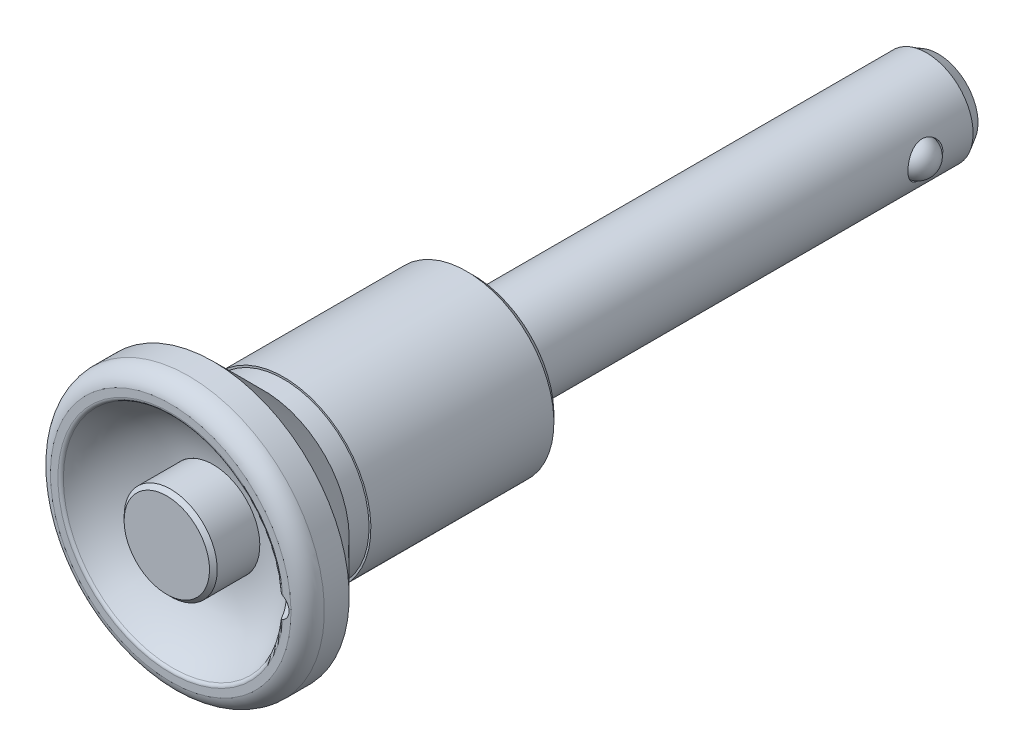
ISO-10303-21;
HEADER;
FILE_DESCRIPTION(('STEP AP214'),'2;1');
FILE_NAME('part.step','',(''),(''),'','','');
FILE_SCHEMA(('AUTOMOTIVE_DESIGN { 1 0 10303 214 1 1 1 1 }'));
ENDSEC;
DATA;
#1=APPLICATION_CONTEXT('core data for automotive mechanical design processes');
#2=APPLICATION_PROTOCOL_DEFINITION('international standard','automotive_design',2000,#1);
#3=PRODUCT_CONTEXT('',#1,'mechanical');
#4=PRODUCT('Part','Part','',(#3));
#5=PRODUCT_RELATED_PRODUCT_CATEGORY('part','',(#4));
#6=PRODUCT_DEFINITION_FORMATION('','',#4);
#7=PRODUCT_DEFINITION_CONTEXT('part definition',#1,'design');
#8=PRODUCT_DEFINITION('design','',#6,#7);
#9=PRODUCT_DEFINITION_SHAPE('','',#8);
#10=(LENGTH_UNIT() NAMED_UNIT(*) SI_UNIT(.MILLI.,.METRE.));
#11=(NAMED_UNIT(*) PLANE_ANGLE_UNIT() SI_UNIT($,.RADIAN.));
#12=(NAMED_UNIT(*) SI_UNIT($,.STERADIAN.) SOLID_ANGLE_UNIT());
#13=UNCERTAINTY_MEASURE_WITH_UNIT(LENGTH_MEASURE(1.E-05),#10,'distance_accuracy_value','');
#14=(GEOMETRIC_REPRESENTATION_CONTEXT(3) GLOBAL_UNCERTAINTY_ASSIGNED_CONTEXT((#13)) GLOBAL_UNIT_ASSIGNED_CONTEXT((#10,
#11,#12)) REPRESENTATION_CONTEXT('',''));
#15=CARTESIAN_POINT('',(0.,0.,0.));
#16=DIRECTION('',(0.,0.,1.));
#17=DIRECTION('',(1.,0.,0.));
#18=AXIS2_PLACEMENT_3D('',#15,#16,#17);
#19=CARTESIAN_POINT('',(0.,0.,-59.9));
#20=DIRECTION('',(0.,0.,-1.));
#21=DIRECTION('',(0.,1.,0.));
#22=AXIS2_PLACEMENT_3D('',#19,#20,#21);
#23=CYLINDRICAL_SURFACE('',#22,6.);
#24=CARTESIAN_POINT('',(-5.56214886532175,2.25,-52.25));
#25=CARTESIAN_POINT('',(-5.5621446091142,2.25000456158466,-52.1284887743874));
#26=CARTESIAN_POINT('',(-5.56617390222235,2.24012396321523,-52.0070076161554));
#27=CARTESIAN_POINT('',(-5.58174238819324,2.20104281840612,-51.7677078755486));
#28=CARTESIAN_POINT('',(-5.59328135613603,2.17184285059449,-51.6498891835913));
#29=CARTESIAN_POINT('',(-5.62238220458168,2.09534486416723,-51.4214369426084));
#30=CARTESIAN_POINT('',(-5.63992964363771,2.04809020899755,-51.3107869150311));
#31=CARTESIAN_POINT('',(-5.67904701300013,1.93697785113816,-51.0989421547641));
#32=CARTESIAN_POINT('',(-5.70061815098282,1.87311516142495,-50.9977502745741));
#33=CARTESIAN_POINT('',(-5.74655362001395,1.72719992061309,-50.802664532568));
#34=CARTESIAN_POINT('',(-5.77100012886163,1.64445571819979,-50.7093072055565));
#35=CARTESIAN_POINT('',(-5.81924625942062,1.46459375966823,-50.5374157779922));
#36=CARTESIAN_POINT('',(-5.84304574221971,1.36747294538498,-50.4588848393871));
#37=CARTESIAN_POINT('',(-5.88829310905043,1.15754198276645,-50.3162907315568));
#38=CARTESIAN_POINT('',(-5.90963341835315,1.04431042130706,-50.2528107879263));
#39=CARTESIAN_POINT('',(-5.94657011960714,0.807833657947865,-50.1460232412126));
#40=CARTESIAN_POINT('',(-5.96216850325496,0.684591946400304,-50.102708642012));
#41=CARTESIAN_POINT('',(-5.98528045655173,0.437234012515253,-50.0393631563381));
#42=CARTESIAN_POINT('',(-5.99311372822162,0.313384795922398,-50.0184085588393));
#43=CARTESIAN_POINT('',(-6.0009602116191,0.0636965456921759,-49.9974181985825));
#44=CARTESIAN_POINT('',(-6.00097596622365,-0.0621418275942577,-49.997375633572));
#45=CARTESIAN_POINT('',(-5.9933889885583,-0.305615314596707,-50.0176726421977));
#46=CARTESIAN_POINT('',(-5.9861631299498,-0.423348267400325,-50.0370039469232));
#47=CARTESIAN_POINT('',(-5.96539912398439,-0.653758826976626,-50.0938038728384));
#48=CARTESIAN_POINT('',(-5.95186052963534,-0.766436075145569,-50.1312737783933));
#49=CARTESIAN_POINT('',(-5.91956653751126,-0.985483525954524,-50.2237556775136));
#50=CARTESIAN_POINT('',(-5.90073809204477,-1.09173808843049,-50.2790150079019));
#51=CARTESIAN_POINT('',(-5.85976965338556,-1.29372991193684,-50.4052881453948));
#52=CARTESIAN_POINT('',(-5.83762859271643,-1.38946376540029,-50.4763070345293));
#53=CARTESIAN_POINT('',(-5.79078794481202,-1.57363573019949,-50.6369409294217));
#54=CARTESIAN_POINT('',(-5.76601445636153,-1.6613192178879,-50.727400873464));
#55=CARTESIAN_POINT('',(-5.71773690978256,-1.82055593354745,-50.921889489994));
#56=CARTESIAN_POINT('',(-5.69423317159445,-1.89210511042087,-51.0259215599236));
#57=CARTESIAN_POINT('',(-5.65069055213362,-2.01848417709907,-51.247579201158));
#58=CARTESIAN_POINT('',(-5.63074015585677,-2.07290771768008,-51.3654552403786));
#59=CARTESIAN_POINT('',(-5.59758657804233,-2.16084696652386,-51.6096443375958));
#60=CARTESIAN_POINT('',(-5.58437964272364,-2.19437430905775,-51.7359526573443));
#61=CARTESIAN_POINT('',(-5.56709395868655,-2.23785287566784,-51.9859639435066));
#62=CARTESIAN_POINT('',(-5.56255177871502,-2.24900281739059,-52.109426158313));
#63=CARTESIAN_POINT('',(-5.56179809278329,-2.25086828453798,-52.3565140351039));
#64=CARTESIAN_POINT('',(-5.56558450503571,-2.24158891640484,-52.4801396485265));
#65=CARTESIAN_POINT('',(-5.58059072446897,-2.20394600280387,-52.7178948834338));
#66=CARTESIAN_POINT('',(-5.59144914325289,-2.17650927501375,-52.8321967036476));
#67=CARTESIAN_POINT('',(-5.61894730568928,-2.10449661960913,-53.0545219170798));
#68=CARTESIAN_POINT('',(-5.63558823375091,-2.05991718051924,-53.1625440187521));
#69=CARTESIAN_POINT('',(-5.67354364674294,-1.95300438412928,-53.3737466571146));
#70=CARTESIAN_POINT('',(-5.69500993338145,-1.8900681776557,-53.4765939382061));
#71=CARTESIAN_POINT('',(-5.73994221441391,-1.74886976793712,-53.6706934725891));
#72=CARTESIAN_POINT('',(-5.76340893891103,-1.67060195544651,-53.761941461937));
#73=CARTESIAN_POINT('',(-5.81149569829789,-1.49509101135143,-53.9362525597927));
#74=CARTESIAN_POINT('',(-5.83609454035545,-1.39695951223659,-54.0184301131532));
#75=CARTESIAN_POINT('',(-5.8822481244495,-1.18769620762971,-54.1652575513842));
#76=CARTESIAN_POINT('',(-5.90380285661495,-1.07656435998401,-54.2299073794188));
#77=CARTESIAN_POINT('',(-5.94142478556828,-0.844524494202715,-54.3394190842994));
#78=CARTESIAN_POINT('',(-5.95751072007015,-0.723651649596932,-54.3843486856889));
#79=CARTESIAN_POINT('',(-5.98244155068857,-0.475322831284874,-54.4529846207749));
#80=CARTESIAN_POINT('',(-5.99128984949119,-0.347869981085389,-54.4767009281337));
#81=CARTESIAN_POINT('',(-6.00042610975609,-0.0980033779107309,-54.5011616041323));
#82=CARTESIAN_POINT('',(-6.00118291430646,0.0242711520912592,-54.5031642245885));
#83=CARTESIAN_POINT('',(-5.99527334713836,0.267340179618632,-54.4873772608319));
#84=CARTESIAN_POINT('',(-5.98860787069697,0.388134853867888,-54.4695900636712));
#85=CARTESIAN_POINT('',(-5.96881634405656,0.621822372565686,-54.4156117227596));
#86=CARTESIAN_POINT('',(-5.95585187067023,0.734836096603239,-54.3798801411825));
#87=CARTESIAN_POINT('',(-5.92481675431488,0.953273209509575,-54.2914849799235));
#88=CARTESIAN_POINT('',(-5.90674514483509,1.05869515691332,-54.2388181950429));
#89=CARTESIAN_POINT('',(-5.86635927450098,1.26381026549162,-54.1155290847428));
#90=CARTESIAN_POINT('',(-5.84389860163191,1.36307632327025,-54.0442450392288));
#91=CARTESIAN_POINT('',(-5.79749261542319,1.54862602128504,-53.8867882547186));
#92=CARTESIAN_POINT('',(-5.77354677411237,1.63490500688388,-53.8006102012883));
#93=CARTESIAN_POINT('',(-5.72532194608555,1.7967182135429,-53.6104038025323));
#94=CARTESIAN_POINT('',(-5.70109208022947,1.87144499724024,-53.5056733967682));
#95=CARTESIAN_POINT('',(-5.65647487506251,2.00227064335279,-53.2843761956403));
#96=CARTESIAN_POINT('',(-5.6360879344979,2.05836757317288,-53.1678081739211));
#97=CARTESIAN_POINT('',(-5.60103404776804,2.15198830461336,-52.9205664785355));
#98=CARTESIAN_POINT('',(-5.58665704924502,2.18859004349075,-52.7894984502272));
#99=CARTESIAN_POINT('',(-5.56721991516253,2.23758535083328,-52.5222720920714));
#100=CARTESIAN_POINT('',(-5.56215363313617,2.24999489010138,-52.3861171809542));
#101=CARTESIAN_POINT('',(-5.56214886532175,2.25,-52.25));
#102=B_SPLINE_CURVE_WITH_KNOTS('',3,(#24,#25,#26,#27,#28,#29,#30,#31,#32,#33,#34,#35,#36,#37,
#38,#39,#40,#41,#42,#43,#44,#45,#46,#47,#48,#49,#50,#51,#52,#53,#54,#55,#56,#57,#58,#59,#60,#61,
#62,#63,#64,#65,#66,#67,#68,#69,#70,#71,#72,#73,#74,#75,#76,#77,#78,#79,#80,#81,#82,#83,#84,#85,
#86,#87,#88,#89,#90,#91,#92,#93,#94,#95,#96,#97,#98,#99,#100,#101),.UNSPECIFIED.,.T.,.F.,(4,2,2,
2,2,2,2,2,2,2,2,2,2,2,2,2,2,2,2,2,2,2,2,2,2,2,2,2,2,2,2,2,2,2,2,2,2,2,4),(0.,0.364026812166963,
0.728042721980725,1.09118978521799,1.45444601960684,1.83411978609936,2.2138744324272,
2.60655108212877,2.99909139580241,3.37470027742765,3.75018698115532,4.10709709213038,
4.46403247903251,4.82616196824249,5.18840840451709,5.57185012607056,5.95538801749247,
6.34743888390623,6.73927127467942,7.10948486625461,7.47960593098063,7.83215768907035,
8.18478170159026,8.55062341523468,8.91659922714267,9.30577525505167,9.69495254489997,
10.0827826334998,10.4704302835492,10.8354858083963,11.2004973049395,11.5566041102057,
11.9127783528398,12.2839248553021,12.6552040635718,13.0460789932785,13.436994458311,
13.8450476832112,14.2528314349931),.UNSPECIFIED.);
#103=CARTESIAN_POINT('',(-5.56214886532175,2.25,-52.25));
#104=VERTEX_POINT('',#103);
#105=EDGE_CURVE('E68',#104,#104,#102,.T.);
#106=ORIENTED_EDGE('',*,*,#105,.T.);
#107=EDGE_LOOP('',(#106));
#108=FACE_BOUND('',#107,.T.);
#109=CARTESIAN_POINT('',(0.,0.,-58.4));
#110=DIRECTION('',(0.,0.,-1.));
#111=DIRECTION('',(0.,1.,0.));
#112=AXIS2_PLACEMENT_3D('',#109,#110,#111);
#113=CIRCLE('',#112,6.);
#114=CARTESIAN_POINT('',(0.,6.,-58.4));
#115=VERTEX_POINT('',#114);
#116=EDGE_CURVE('E309',#115,#115,#113,.T.);
#117=ORIENTED_EDGE('',*,*,#116,.F.);
#118=EDGE_LOOP('',(#117));
#119=FACE_BOUND('',#118,.T.);
#120=CARTESIAN_POINT('',(5.56214886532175,2.25,-52.25));
#121=CARTESIAN_POINT('',(5.5621446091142,2.25000456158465,-52.3715112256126));
#122=CARTESIAN_POINT('',(5.56617390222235,2.24012396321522,-52.4929923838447));
#123=CARTESIAN_POINT('',(5.58174238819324,2.20104281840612,-52.7322921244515));
#124=CARTESIAN_POINT('',(5.59328135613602,2.1718428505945,-52.8501108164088));
#125=CARTESIAN_POINT('',(5.62238220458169,2.09534486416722,-53.0785630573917));
#126=CARTESIAN_POINT('',(5.63992964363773,2.0480902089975,-53.189213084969));
#127=CARTESIAN_POINT('',(5.67904701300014,1.93697785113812,-53.401057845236));
#128=CARTESIAN_POINT('',(5.70061815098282,1.87311516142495,-53.502249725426));
#129=CARTESIAN_POINT('',(5.74655362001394,1.72719992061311,-53.6973354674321));
#130=CARTESIAN_POINT('',(5.77100012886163,1.64445571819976,-53.7906927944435));
#131=CARTESIAN_POINT('',(5.81924625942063,1.46459375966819,-53.9625842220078));
#132=CARTESIAN_POINT('',(5.84304574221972,1.36747294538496,-54.0411151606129));
#133=CARTESIAN_POINT('',(5.88829310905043,1.15754198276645,-54.1837092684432));
#134=CARTESIAN_POINT('',(5.90963341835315,1.04431042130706,-54.2471892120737));
#135=CARTESIAN_POINT('',(5.94657011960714,0.807833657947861,-54.3539767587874));
#136=CARTESIAN_POINT('',(5.96216850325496,0.684591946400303,-54.397291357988));
#137=CARTESIAN_POINT('',(5.98528045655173,0.437234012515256,-54.4606368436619));
#138=CARTESIAN_POINT('',(5.99311372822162,0.313384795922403,-54.4815914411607));
#139=CARTESIAN_POINT('',(6.0009602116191,0.0636965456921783,-54.5025818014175));
#140=CARTESIAN_POINT('',(6.00097596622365,-0.0621418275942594,-54.5026243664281));
#141=CARTESIAN_POINT('',(5.9933889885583,-0.305615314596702,-54.4823273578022));
#142=CARTESIAN_POINT('',(5.9861631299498,-0.42334826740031,-54.4629960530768));
#143=CARTESIAN_POINT('',(5.96539912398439,-0.653758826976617,-54.4061961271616));
#144=CARTESIAN_POINT('',(5.95186052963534,-0.766436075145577,-54.3687262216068));
#145=CARTESIAN_POINT('',(5.91956653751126,-0.985483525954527,-54.2762443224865));
#146=CARTESIAN_POINT('',(5.90073809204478,-1.09173808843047,-54.2209849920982));
#147=CARTESIAN_POINT('',(5.85976965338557,-1.29372991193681,-54.0947118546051));
#148=CARTESIAN_POINT('',(5.83762859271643,-1.38946376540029,-54.0236929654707));
#149=CARTESIAN_POINT('',(5.79078794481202,-1.57363573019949,-53.8630590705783));
#150=CARTESIAN_POINT('',(5.76601445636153,-1.6613192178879,-53.772599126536));
#151=CARTESIAN_POINT('',(5.71773690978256,-1.82055593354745,-53.578110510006));
#152=CARTESIAN_POINT('',(5.69423317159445,-1.89210511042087,-53.4740784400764));
#153=CARTESIAN_POINT('',(5.65069055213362,-2.01848417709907,-53.252420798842));
#154=CARTESIAN_POINT('',(5.63074015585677,-2.07290771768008,-53.1345447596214));
#155=CARTESIAN_POINT('',(5.59758657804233,-2.16084696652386,-52.8903556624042));
#156=CARTESIAN_POINT('',(5.58437964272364,-2.19437430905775,-52.7640473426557));
#157=CARTESIAN_POINT('',(5.56709395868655,-2.23785287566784,-52.5140360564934));
#158=CARTESIAN_POINT('',(5.56255177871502,-2.24900281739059,-52.3905738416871));
#159=CARTESIAN_POINT('',(5.56179809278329,-2.25086828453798,-52.1434859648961));
#160=CARTESIAN_POINT('',(5.56558450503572,-2.24158891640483,-52.0198603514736));
#161=CARTESIAN_POINT('',(5.58059072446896,-2.20394600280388,-51.7821051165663));
#162=CARTESIAN_POINT('',(5.59144914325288,-2.17650927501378,-51.6678032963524));
#163=CARTESIAN_POINT('',(5.61894730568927,-2.10449661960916,-51.4454780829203));
#164=CARTESIAN_POINT('',(5.63558823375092,-2.05991718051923,-51.337455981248));
#165=CARTESIAN_POINT('',(5.67354364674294,-1.95300438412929,-51.1262533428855));
#166=CARTESIAN_POINT('',(5.69500993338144,-1.89006817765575,-51.023406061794));
#167=CARTESIAN_POINT('',(5.73994221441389,-1.74886976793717,-50.829306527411));
#168=CARTESIAN_POINT('',(5.76340893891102,-1.67060195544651,-50.7380585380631));
#169=CARTESIAN_POINT('',(5.8114956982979,-1.49509101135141,-50.5637474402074));
#170=CARTESIAN_POINT('',(5.83609454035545,-1.3969595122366,-50.4815698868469));
#171=CARTESIAN_POINT('',(5.88224812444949,-1.18769620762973,-50.3347424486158));
#172=CARTESIAN_POINT('',(5.90380285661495,-1.07656435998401,-50.2700926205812));
#173=CARTESIAN_POINT('',(5.94142478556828,-0.844524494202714,-50.1605809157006));
#174=CARTESIAN_POINT('',(5.95751072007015,-0.723651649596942,-50.1156513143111));
#175=CARTESIAN_POINT('',(5.98244155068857,-0.475322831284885,-50.0470153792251));
#176=CARTESIAN_POINT('',(5.99128984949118,-0.34786998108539,-50.0232990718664));
#177=CARTESIAN_POINT('',(6.0004261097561,-0.0980033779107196,-49.9988383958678));
#178=CARTESIAN_POINT('',(6.00118291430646,0.0242711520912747,-49.9968357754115));
#179=CARTESIAN_POINT('',(5.99527334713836,0.267340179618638,-50.0126227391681));
#180=CARTESIAN_POINT('',(5.98860787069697,0.38813485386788,-50.0304099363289));
#181=CARTESIAN_POINT('',(5.96881634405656,0.621822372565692,-50.0843882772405));
#182=CARTESIAN_POINT('',(5.95585187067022,0.734836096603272,-50.1201198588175));
#183=CARTESIAN_POINT('',(5.92481675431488,0.953273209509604,-50.2085150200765));
#184=CARTESIAN_POINT('',(5.90674514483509,1.05869515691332,-50.2611818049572));
#185=CARTESIAN_POINT('',(5.86635927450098,1.26381026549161,-50.3844709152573));
#186=CARTESIAN_POINT('',(5.8438986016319,1.36307632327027,-50.4557549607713));
#187=CARTESIAN_POINT('',(5.79749261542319,1.54862602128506,-50.6132117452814));
#188=CARTESIAN_POINT('',(5.77354677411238,1.63490500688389,-50.6993897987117));
#189=CARTESIAN_POINT('',(5.72532194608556,1.7967182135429,-50.8895961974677));
#190=CARTESIAN_POINT('',(5.70109208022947,1.87144499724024,-50.9943266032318));
#191=CARTESIAN_POINT('',(5.6564748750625,2.00227064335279,-51.2156238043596));
#192=CARTESIAN_POINT('',(5.63608793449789,2.05836757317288,-51.3321918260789));
#193=CARTESIAN_POINT('',(5.60103404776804,2.15198830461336,-51.5794335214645));
#194=CARTESIAN_POINT('',(5.58665704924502,2.18859004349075,-51.7105015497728));
#195=CARTESIAN_POINT('',(5.56721991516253,2.23758535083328,-51.9777279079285));
#196=CARTESIAN_POINT('',(5.56215363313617,2.24999489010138,-52.1138828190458));
#197=CARTESIAN_POINT('',(5.56214886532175,2.25,-52.25));
#198=B_SPLINE_CURVE_WITH_KNOTS('',3,(#120,#121,#122,#123,#124,#125,#126,#127,#128,#129,#130,
#131,#132,#133,#134,#135,#136,#137,#138,#139,#140,#141,#142,#143,#144,#145,#146,#147,#148,#149,
#150,#151,#152,#153,#154,#155,#156,#157,#158,#159,#160,#161,#162,#163,#164,#165,#166,#167,#168,
#169,#170,#171,#172,#173,#174,#175,#176,#177,#178,#179,#180,#181,#182,#183,#184,#185,#186,#187,
#188,#189,#190,#191,#192,#193,#194,#195,#196,#197),.UNSPECIFIED.,.T.,.F.,(4,2,2,2,2,2,2,2,2,2,2,
2,2,2,2,2,2,2,2,2,2,2,2,2,2,2,2,2,2,2,2,2,2,2,2,2,2,2,4),(0.,0.364026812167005,
0.728042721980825,1.09118978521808,1.45444601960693,1.83411978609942,2.21387443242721,
2.6065510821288,2.99909139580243,3.37470027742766,3.75018698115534,4.10709709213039,
4.4640324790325,4.82616196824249,5.18840840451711,5.57185012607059,5.95538801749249,
6.34743888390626,6.73927127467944,7.10948486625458,7.47960593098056,7.83215768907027,
8.18478170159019,8.55062341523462,8.91659922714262,9.30577525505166,9.69495254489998,
10.0827826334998,10.4704302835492,10.8354858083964,11.2004973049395,11.5566041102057,
11.9127783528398,12.2839248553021,12.6552040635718,13.0460789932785,13.4369944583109,
13.8450476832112,14.2528314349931),.UNSPECIFIED.);
#199=CARTESIAN_POINT('',(5.56214886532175,2.25,-52.25));
#200=VERTEX_POINT('',#199);
#201=EDGE_CURVE('E287',#200,#200,#198,.T.);
#202=ORIENTED_EDGE('',*,*,#201,.T.);
#203=EDGE_LOOP('',(#202));
#204=FACE_BOUND('',#203,.T.);
#205=CARTESIAN_POINT('',(0.,0.,0.));
#206=DIRECTION('',(0.,0.,1.));
#207=DIRECTION('',(1.,0.,0.));
#208=AXIS2_PLACEMENT_3D('',#205,#206,#207);
#209=CIRCLE('',#208,6.);
#210=CARTESIAN_POINT('',(6.,0.,0.));
#211=VERTEX_POINT('',#210);
#212=EDGE_CURVE('E80',#211,#211,#209,.T.);
#213=ORIENTED_EDGE('',*,*,#212,.F.);
#214=EDGE_LOOP('',(#213));
#215=FACE_BOUND('',#214,.T.);
#216=ADVANCED_FACE('F14',(#108,#119,#204,#215),#23,.T.);
#217=CARTESIAN_POINT('',(0.,0.,-59.9));
#218=DIRECTION('',(0.,0.,-1.));
#219=DIRECTION('',(0.,1.,0.));
#220=AXIS2_PLACEMENT_3D('',#217,#218,#219);
#221=CYLINDRICAL_SURFACE('',#220,2.75);
#222=CARTESIAN_POINT('',(0.,0.,-54.5));
#223=DIRECTION('',(0.,0.,-1.));
#224=DIRECTION('',(0.,1.,0.));
#225=AXIS2_PLACEMENT_3D('',#222,#223,#224);
#226=CIRCLE('',#225,2.75);
#227=CARTESIAN_POINT('',(0.,2.75,-54.5));
#228=VERTEX_POINT('',#227);
#229=EDGE_CURVE('E74',#228,#228,#226,.T.);
#230=ORIENTED_EDGE('',*,*,#229,.F.);
#231=EDGE_LOOP('',(#230));
#232=FACE_BOUND('',#231,.T.);
#233=CARTESIAN_POINT('',(0.,0.,-59.9));
#234=DIRECTION('',(0.,0.,-1.));
#235=DIRECTION('',(0.,1.,0.));
#236=AXIS2_PLACEMENT_3D('',#233,#234,#235);
#237=CIRCLE('',#236,2.75);
#238=CARTESIAN_POINT('',(0.,2.75,-59.9));
#239=VERTEX_POINT('',#238);
#240=EDGE_CURVE('E301',#239,#239,#237,.T.);
#241=ORIENTED_EDGE('',*,*,#240,.T.);
#242=EDGE_LOOP('',(#241));
#243=FACE_BOUND('',#242,.T.);
#244=ADVANCED_FACE('F269',(#232,#243),#221,.F.);
#245=CARTESIAN_POINT('',(2.75,0.,-59.9));
#246=DIRECTION('',(0.,0.,-1.));
#247=DIRECTION('',(0.,1.,0.));
#248=AXIS2_PLACEMENT_3D('',#245,#246,#247);
#249=PLANE('',#248);
#250=CARTESIAN_POINT('',(0.,0.,-59.9));
#251=DIRECTION('',(0.,0.,-1.));
#252=DIRECTION('',(0.,1.,0.));
#253=AXIS2_PLACEMENT_3D('',#250,#251,#252);
#254=CIRCLE('',#253,5.13397459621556);
#255=CARTESIAN_POINT('',(0.,5.13397459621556,-59.9));
#256=VERTEX_POINT('',#255);
#257=EDGE_CURVE('E305',#256,#256,#254,.T.);
#258=ORIENTED_EDGE('',*,*,#257,.T.);
#259=EDGE_LOOP('',(#258));
#260=FACE_BOUND('',#259,.T.);
#261=ORIENTED_EDGE('',*,*,#240,.F.);
#262=EDGE_LOOP('',(#261));
#263=FACE_BOUND('',#262,.T.);
#264=ADVANCED_FACE('F275',(#260,#263),#249,.T.);
#265=CARTESIAN_POINT('',(0.,0.,-59.9));
#266=DIRECTION('',(0.,0.,1.));
#267=DIRECTION('',(0.,-1.,0.));
#268=AXIS2_PLACEMENT_3D('',#265,#266,#267);
#269=CONICAL_SURFACE('',#268,5.13397459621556,0.523598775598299);
#270=ORIENTED_EDGE('',*,*,#116,.T.);
#271=EDGE_LOOP('',(#270));
#272=FACE_BOUND('',#271,.T.);
#273=ORIENTED_EDGE('',*,*,#257,.F.);
#274=EDGE_LOOP('',(#273));
#275=FACE_BOUND('',#274,.T.);
#276=ADVANCED_FACE('F283',(#272,#275),#269,.T.);
#277=CARTESIAN_POINT('',(7.,0.,-52.25));
#278=DIRECTION('',(1.,0.,0.));
#279=DIRECTION('',(0.,1.,0.));
#280=AXIS2_PLACEMENT_3D('',#277,#278,#279);
#281=CYLINDRICAL_SURFACE('',#280,2.25);
#282=CARTESIAN_POINT('',(4.70120856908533,2.25,-52.25));
#283=CARTESIAN_POINT('',(4.70121469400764,2.24999417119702,-52.1304590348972));
#284=CARTESIAN_POINT('',(4.70583400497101,2.2404126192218,-52.0107125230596));
#285=CARTESIAN_POINT('',(4.72369711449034,2.20249080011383,-51.774718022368));
#286=CARTESIAN_POINT('',(4.73696351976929,2.17410135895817,-51.6584800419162));
#287=CARTESIAN_POINT('',(4.77031963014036,2.09989154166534,-51.4333349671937));
#288=CARTESIAN_POINT('',(4.79038009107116,2.05414577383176,-51.324398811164));
#289=CARTESIAN_POINT('',(4.83501981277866,1.94674472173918,-51.1157771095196));
#290=CARTESIAN_POINT('',(4.85959823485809,1.88509238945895,-51.016089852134));
#291=CARTESIAN_POINT('',(4.91234222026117,1.74321937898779,-50.8220680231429));
#292=CARTESIAN_POINT('',(4.94063496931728,1.66209866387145,-50.7284258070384));
#293=CARTESIAN_POINT('',(4.99657815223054,1.485478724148,-50.5555585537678));
#294=CARTESIAN_POINT('',(5.02422832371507,1.38997374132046,-50.4763393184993));
#295=CARTESIAN_POINT('',(5.07733633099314,1.18176930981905,-50.3309420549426));
#296=CARTESIAN_POINT('',(5.10262925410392,1.06847133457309,-50.2655553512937));
#297=CARTESIAN_POINT('',(5.14660113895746,0.831192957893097,-50.1550726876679));
#298=CARTESIAN_POINT('',(5.16528324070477,0.707217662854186,-50.1099670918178));
#299=CARTESIAN_POINT('',(5.1930243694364,0.459385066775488,-50.0438746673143));
#300=CARTESIAN_POINT('',(5.20255899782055,0.33590140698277,-50.0216905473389));
#301=CARTESIAN_POINT('',(5.21266651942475,0.0866213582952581,-49.9981895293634));
#302=CARTESIAN_POINT('',(5.21324333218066,-0.0391739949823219,-49.9968635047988));
#303=CARTESIAN_POINT('',(5.20564133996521,-0.280752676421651,-50.0145162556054));
#304=CARTESIAN_POINT('',(5.19803132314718,-0.396653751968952,-50.0321759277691));
#305=CARTESIAN_POINT('',(5.17570524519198,-0.623658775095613,-50.0850210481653));
#306=CARTESIAN_POINT('',(5.16098865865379,-0.734762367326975,-50.1202077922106));
#307=CARTESIAN_POINT('',(5.12557562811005,-0.951074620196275,-50.2075078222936));
#308=CARTESIAN_POINT('',(5.10479112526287,-1.05616705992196,-50.2598718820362));
#309=CARTESIAN_POINT('',(5.05924909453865,-1.25634985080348,-50.3797828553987));
#310=CARTESIAN_POINT('',(5.03449013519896,-1.35143657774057,-50.4473352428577));
#311=CARTESIAN_POINT('',(4.9812692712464,-1.53647964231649,-50.6015757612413));
#312=CARTESIAN_POINT('',(4.95266891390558,-1.62551877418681,-50.689317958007));
#313=CARTESIAN_POINT('',(4.89634671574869,-1.78803350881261,-50.8785052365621));
#314=CARTESIAN_POINT('',(4.8686252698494,-1.86150219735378,-50.9799563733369));
#315=CARTESIAN_POINT('',(4.81616806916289,-1.99339518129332,-51.1984520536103));
#316=CARTESIAN_POINT('',(4.79158303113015,-2.05115292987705,-51.3159383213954));
#317=CARTESIAN_POINT('',(4.75001097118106,-2.1456830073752,-51.5603104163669));
#318=CARTESIAN_POINT('',(4.73301805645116,-2.18247161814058,-51.6871888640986));
#319=CARTESIAN_POINT('',(4.7100473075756,-2.2315930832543,-51.9375319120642));
#320=CARTESIAN_POINT('',(4.70339790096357,-2.24542132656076,-52.0606401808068));
#321=CARTESIAN_POINT('',(4.69994279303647,-2.25264846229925,-52.3075714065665));
#322=CARTESIAN_POINT('',(4.70313324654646,-2.24605533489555,-52.4313940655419));
#323=CARTESIAN_POINT('',(4.71830050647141,-2.21399394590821,-52.6669653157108));
#324=CARTESIAN_POINT('',(4.72963794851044,-2.18989787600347,-52.778947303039));
#325=CARTESIAN_POINT('',(4.75898261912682,-2.12536894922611,-52.9971687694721));
#326=CARTESIAN_POINT('',(4.77699148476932,-2.08493208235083,-53.1034068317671));
#327=CARTESIAN_POINT('',(4.81860535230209,-1.98691927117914,-53.3123309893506));
#328=CARTESIAN_POINT('',(4.84242072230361,-1.92867086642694,-53.414658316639));
#329=CARTESIAN_POINT('',(4.89268495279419,-1.79734114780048,-53.608600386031));
#330=CARTESIAN_POINT('',(4.91913500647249,-1.72425309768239,-53.7002102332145));
#331=CARTESIAN_POINT('',(4.97451487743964,-1.5576964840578,-53.8785741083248));
#332=CARTESIAN_POINT('',(5.00345675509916,-1.46299589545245,-53.9641786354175));
#333=CARTESIAN_POINT('',(5.05840859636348,-1.25992784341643,-54.11851397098));
#334=CARTESIAN_POINT('',(5.0844182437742,-1.15155890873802,-54.1872429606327));
#335=CARTESIAN_POINT('',(5.13083610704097,-0.923055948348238,-54.3059980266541));
#336=CARTESIAN_POINT('',(5.15121223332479,-0.802859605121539,-54.3559175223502));
#337=CARTESIAN_POINT('',(5.18380508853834,-0.554662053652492,-54.4344361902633));
#338=CARTESIAN_POINT('',(5.19602706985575,-0.426665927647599,-54.4630490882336));
#339=CARTESIAN_POINT('',(5.21029045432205,-0.176736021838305,-54.4963229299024));
#340=CARTESIAN_POINT('',(5.21301888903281,-0.0550554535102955,-54.5026010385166));
#341=CARTESIAN_POINT('',(5.20993078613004,0.187600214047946,-54.495446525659));
#342=CARTESIAN_POINT('',(5.2041159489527,0.308575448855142,-54.4820178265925));
#343=CARTESIAN_POINT('',(5.18496872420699,0.541359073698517,-54.436990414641));
#344=CARTESIAN_POINT('',(5.17194743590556,0.653340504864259,-54.4061426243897));
#345=CARTESIAN_POINT('',(5.13986314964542,0.870473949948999,-54.3280030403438));
#346=CARTESIAN_POINT('',(5.12079904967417,0.975624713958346,-54.2807082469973));
#347=CARTESIAN_POINT('',(5.07736891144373,1.18141977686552,-54.1686191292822));
#348=CARTESIAN_POINT('',(5.05280038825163,1.28163851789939,-54.1031238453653));
#349=CARTESIAN_POINT('',(5.00122306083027,1.47009921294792,-53.957485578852));
#350=CARTESIAN_POINT('',(4.9742132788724,1.5583363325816,-53.877336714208));
#351=CARTESIAN_POINT('',(4.9182708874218,1.72712341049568,-53.6976966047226));
#352=CARTESIAN_POINT('',(4.88934356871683,1.80662459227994,-53.5972140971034));
#353=CARTESIAN_POINT('',(4.83482876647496,1.94782882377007,-53.3835276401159));
#354=CARTESIAN_POINT('',(4.80924325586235,2.00952138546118,-53.270316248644));
#355=CARTESIAN_POINT('',(4.76470338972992,2.11297708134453,-53.0338474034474));
#356=CARTESIAN_POINT('',(4.74574393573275,2.15475554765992,-52.9105977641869));
#357=CARTESIAN_POINT('',(4.72435108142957,2.20105394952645,-52.7212685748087));
#358=CARTESIAN_POINT('',(4.71839681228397,2.21375426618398,-52.6574783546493));
#359=CARTESIAN_POINT('',(4.70903769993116,2.23359624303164,-52.5288695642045));
#360=CARTESIAN_POINT('',(4.70563091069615,2.2407421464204,-52.4640518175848));
#361=CARTESIAN_POINT('',(4.7027842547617,2.24670526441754,-52.3742341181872));
#362=CARTESIAN_POINT('',(4.70219412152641,2.24794009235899,-52.349407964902));
#363=CARTESIAN_POINT('',(4.70140563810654,2.24958807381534,-52.2997241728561));
#364=CARTESIAN_POINT('',(4.70120729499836,2.25000121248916,-52.2748665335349));
#365=CARTESIAN_POINT('',(4.70120856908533,2.25,-52.25));
#366=B_SPLINE_CURVE_WITH_KNOTS('',3,(#282,#283,#284,#285,#286,#287,#288,#289,#290,#291,#292,
#293,#294,#295,#296,#297,#298,#299,#300,#301,#302,#303,#304,#305,#306,#307,#308,#309,#310,#311,
#312,#313,#314,#315,#316,#317,#318,#319,#320,#321,#322,#323,#324,#325,#326,#327,#328,#329,#330,
#331,#332,#333,#334,#335,#336,#337,#338,#339,#340,#341,#342,#343,#344,#345,#346,#347,#348,#349,
#350,#351,#352,#353,#354,#355,#356,#357,#358,#359,#360,#361,#362,#363,#364,#365),.UNSPECIFIED.,
.T.,.F.,(4,2,2,2,2,2,2,2,2,2,2,2,2,2,2,2,2,2,2,2,2,2,2,2,2,2,2,2,2,2,2,2,2,2,2,2,2,2,2,2,2,4),
(0.,0.35852328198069,0.717987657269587,1.07592402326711,1.43379401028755,1.81338979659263,
2.19313794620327,2.5907971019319,2.98826712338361,3.36372670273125,3.73902199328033,
4.08983186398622,4.44066767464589,4.79687203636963,5.15320497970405,5.53621810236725,
5.91940095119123,6.31693575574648,6.71416146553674,7.08432459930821,7.4543431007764,
7.7981123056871,8.14196592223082,8.50086375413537,8.85992486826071,9.2508012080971,
9.64171965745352,10.0348210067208,10.427668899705,10.7914180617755,11.1550948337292,
11.5041747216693,11.8533183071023,12.2184179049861,12.583664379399,12.9758816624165,
13.3683294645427,13.7604746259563,13.9561801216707,14.1517359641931,14.2263134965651,
14.3008923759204),.UNSPECIFIED.);
#367=CARTESIAN_POINT('',(4.84677342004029,1.91641577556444,-53.4289192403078));
#368=VERTEX_POINT('',#367);
#369=CARTESIAN_POINT('',(4.84677342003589,-1.91641577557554,-53.4289192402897));
#370=VERTEX_POINT('',#369);
#371=EDGE_CURVE('E70',#368,#370,#366,.T.);
#372=ORIENTED_EDGE('',*,*,#371,.F.);
#373=CARTESIAN_POINT('',(5.21189620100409,0.,-54.5));
#374=CARTESIAN_POINT('',(5.2118961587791,0.126284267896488,-54.4999948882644));
#375=CARTESIAN_POINT('',(5.21139467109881,0.25264400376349,-54.4893340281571));
#376=CARTESIAN_POINT('',(5.20938058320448,0.501864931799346,-54.4469613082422));
#377=CARTESIAN_POINT('',(5.20786696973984,0.624722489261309,-54.4152283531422));
#378=CARTESIAN_POINT('',(5.20380519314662,0.863320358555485,-54.3316208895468));
#379=CARTESIAN_POINT('',(5.20125743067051,0.979063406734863,-54.2797541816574));
#380=CARTESIAN_POINT('',(5.19508229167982,1.20015943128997,-54.1573752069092));
#381=CARTESIAN_POINT('',(5.19145518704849,1.30551501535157,-54.0868676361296));
#382=CARTESIAN_POINT('',(5.18303472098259,1.50291352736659,-53.9291996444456));
#383=CARTESIAN_POINT('',(5.17824107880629,1.59495324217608,-53.8420352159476));
#384=CARTESIAN_POINT('',(5.16733442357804,1.76311423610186,-53.653525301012));
#385=CARTESIAN_POINT('',(5.1612210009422,1.83923055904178,-53.5521754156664));
#386=CARTESIAN_POINT('',(5.14734400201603,1.97343552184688,-53.3381336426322));
#387=CARTESIAN_POINT('',(5.13957863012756,2.03150437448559,-53.2254294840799));
#388=CARTESIAN_POINT('',(5.12176723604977,2.12782849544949,-52.9921124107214));
#389=CARTESIAN_POINT('',(5.11172400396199,2.1661078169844,-52.8715092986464));
#390=CARTESIAN_POINT('',(5.0933054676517,2.2077406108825,-52.6884429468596));
#391=CARTESIAN_POINT('',(5.08666779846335,2.21896106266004,-52.6275162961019));
#392=CARTESIAN_POINT('',(5.07117135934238,2.23631965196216,-52.5053136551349));
#393=CARTESIAN_POINT('',(5.06231462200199,2.24246241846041,-52.444038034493));
#394=CARTESIAN_POINT('',(5.0447395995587,2.24786649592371,-52.3524947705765));
#395=CARTESIAN_POINT('',(5.03817832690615,2.24903385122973,-52.3220839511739));
#396=CARTESIAN_POINT('',(5.02487846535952,2.24972982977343,-52.2856268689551));
#397=CARTESIAN_POINT('',(5.02196282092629,2.24983087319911,-52.278411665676));
#398=CARTESIAN_POINT('',(5.01679668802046,2.24992122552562,-52.2690075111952));
#399=CARTESIAN_POINT('',(5.01524668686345,2.24994100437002,-52.2664653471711));
#400=CARTESIAN_POINT('',(5.01258312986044,2.24996347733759,-52.2628773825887));
#401=CARTESIAN_POINT('',(5.01163231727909,2.24996978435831,-52.2617128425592));
#402=CARTESIAN_POINT('',(5.00957474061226,2.24998007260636,-52.2595306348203));
#403=CARTESIAN_POINT('',(5.00846878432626,2.24998406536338,-52.258512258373));
#404=CARTESIAN_POINT('',(5.0067156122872,2.2499883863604,-52.2572404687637));
#405=CARTESIAN_POINT('',(5.00615104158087,2.2499895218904,-52.2568745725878));
#406=CARTESIAN_POINT('',(5.00497729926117,2.2499914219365,-52.2562214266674));
#407=CARTESIAN_POINT('',(5.00436814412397,2.24999218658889,-52.255934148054));
#408=CARTESIAN_POINT('',(5.00310140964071,2.24999338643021,-52.2554607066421));
#409=CARTESIAN_POINT('',(5.00244330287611,2.24999381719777,-52.2552759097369));
#410=CARTESIAN_POINT('',(5.0011038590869,2.24999436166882,-52.2550386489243));
#411=CARTESIAN_POINT('',(5.00042256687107,2.24999447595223,-52.2549859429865));
#412=CARTESIAN_POINT('',(4.99914424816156,2.24999440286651,-52.2550185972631));
#413=CARTESIAN_POINT('',(4.99854676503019,2.24999424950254,-52.2550883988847));
#414=CARTESIAN_POINT('',(4.99737209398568,2.24999369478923,-52.2553279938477));
#415=CARTESIAN_POINT('',(4.99679493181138,2.24999329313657,-52.2554979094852));
#416=CARTESIAN_POINT('',(4.99546550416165,2.24999202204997,-52.255998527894));
#417=CARTESIAN_POINT('',(4.99472705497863,2.24999103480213,-52.2563654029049));
#418=CARTESIAN_POINT('',(4.99331619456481,2.24998849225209,-52.2572086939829));
#419=CARTESIAN_POINT('',(4.99264394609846,2.24998693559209,-52.257685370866));
#420=CARTESIAN_POINT('',(4.99079786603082,2.24998155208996,-52.2591607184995));
#421=CARTESIAN_POINT('',(4.98969889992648,2.24997693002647,-52.2602516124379));
#422=CARTESIAN_POINT('',(4.98765562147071,2.24996520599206,-52.2625688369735));
#423=CARTESIAN_POINT('',(4.9867118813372,2.249958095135,-52.2637956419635));
#424=CARTESIAN_POINT('',(4.98193653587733,2.2499128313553,-52.2705312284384));
#425=CARTESIAN_POINT('',(4.97899990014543,2.24985038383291,-52.2766418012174));
#426=CARTESIAN_POINT('',(4.97376920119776,2.24966896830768,-52.2891278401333));
#427=CARTESIAN_POINT('',(4.97148201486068,2.24954942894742,-52.2955053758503));
#428=CARTESIAN_POINT('',(4.96106149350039,2.24881762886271,-52.3271058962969));
#429=CARTESIAN_POINT('',(4.95530816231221,2.24778447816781,-52.3531043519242));
#430=CARTESIAN_POINT('',(4.94501184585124,2.24479018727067,-52.4053004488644));
#431=CARTESIAN_POINT('',(4.94047527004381,2.24282427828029,-52.4314984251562));
#432=CARTESIAN_POINT('',(4.92798476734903,2.23550007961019,-52.5104298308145));
#433=CARTESIAN_POINT('',(4.92120435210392,2.22872063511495,-52.5632520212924));
#434=CARTESIAN_POINT('',(4.9089113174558,2.21142389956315,-52.6682645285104));
#435=CARTESIAN_POINT('',(4.90339617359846,2.20091415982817,-52.7204559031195));
#436=CARTESIAN_POINT('',(4.88803764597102,2.16373012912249,-52.8762327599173));
#437=CARTESIAN_POINT('',(4.87942579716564,2.13143364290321,-52.9786677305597));
#438=CARTESIAN_POINT('',(4.86395279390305,2.05263870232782,-53.1776953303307));
#439=CARTESIAN_POINT('',(4.85708717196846,2.00617717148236,-53.2743023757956));
#440=CARTESIAN_POINT('',(4.84463430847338,1.89998698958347,-53.4599495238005));
#441=CARTESIAN_POINT('',(4.83904642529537,1.84026502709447,-53.5489934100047));
#442=CARTESIAN_POINT('',(4.82796886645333,1.69683921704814,-53.7329593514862));
#443=CARTESIAN_POINT('',(4.82267830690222,1.61075316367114,-53.8260495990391));
#444=CARTESIAN_POINT('',(4.81331124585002,1.42411005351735,-53.9965405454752));
#445=CARTESIAN_POINT('',(4.80923548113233,1.32354426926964,-54.0739317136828));
#446=CARTESIAN_POINT('',(4.80219403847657,1.11084101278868,-54.2107437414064));
#447=CARTESIAN_POINT('',(4.79922814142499,0.998705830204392,-54.270168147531));
#448=CARTESIAN_POINT('',(4.79434733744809,0.766047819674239,-54.3693541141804));
#449=CARTESIAN_POINT('',(4.7924323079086,0.645525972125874,-54.4091179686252));
#450=CARTESIAN_POINT('',(4.78962227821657,0.399571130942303,-54.4678412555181));
#451=CARTESIAN_POINT('',(4.78872674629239,0.274140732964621,-54.4868115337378));
#452=CARTESIAN_POINT('',(4.78794106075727,0.0218703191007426,-54.5034420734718));
#453=CARTESIAN_POINT('',(4.78805091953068,-0.104969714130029,-54.5011020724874));
#454=CARTESIAN_POINT('',(4.78927737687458,-0.356418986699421,-54.4751821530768));
#455=CARTESIAN_POINT('',(4.79039368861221,-0.481028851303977,-54.4516082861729));
#456=CARTESIAN_POINT('',(4.79364906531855,-0.724519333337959,-54.3839024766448));
#457=CARTESIAN_POINT('',(4.79578813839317,-0.843399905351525,-54.339770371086));
#458=CARTESIAN_POINT('',(4.80112512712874,-1.0720730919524,-54.2322025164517));
#459=CARTESIAN_POINT('',(4.80432317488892,-1.18186457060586,-54.1687643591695));
#460=CARTESIAN_POINT('',(4.81184515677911,-1.3892259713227,-54.0244041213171));
#461=CARTESIAN_POINT('',(4.81616903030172,-1.48679655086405,-53.9434829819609));
#462=CARTESIAN_POINT('',(4.82606445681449,-1.66699500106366,-53.7664389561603));
#463=CARTESIAN_POINT('',(4.8316364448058,-1.74961764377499,-53.6703107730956));
#464=CARTESIAN_POINT('',(4.84427017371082,-1.89756793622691,-53.465602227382));
#465=CARTESIAN_POINT('',(4.85133233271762,-1.96289072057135,-53.3570183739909));
#466=CARTESIAN_POINT('',(4.86742332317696,-2.07443577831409,-53.1304409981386));
#467=CARTESIAN_POINT('',(4.87645418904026,-2.12063814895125,-53.0124378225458));
#468=CARTESIAN_POINT('',(4.89787609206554,-2.19253624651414,-52.7707327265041));
#469=CARTESIAN_POINT('',(4.91026387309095,-2.2182517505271,-52.6470364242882));
#470=CARTESIAN_POINT('',(4.9348915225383,-2.24079197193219,-52.4621887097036));
#471=CARTESIAN_POINT('',(4.94392093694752,-2.24567525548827,-52.4016395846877));
#472=CARTESIAN_POINT('',(4.96144377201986,-2.24865520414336,-52.3288938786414));
#473=CARTESIAN_POINT('',(4.96488235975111,-2.24907569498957,-52.3157504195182));
#474=CARTESIAN_POINT('',(4.97117438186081,-2.24953233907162,-52.2963421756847));
#475=CARTESIAN_POINT('',(4.97347535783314,-2.24965571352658,-52.2898919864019));
#476=CARTESIAN_POINT('',(4.97872381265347,-2.2498436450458,-52.277231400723));
#477=CARTESIAN_POINT('',(4.98166680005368,-2.24990859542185,-52.2710196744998));
#478=CARTESIAN_POINT('',(4.98649447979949,-2.24995636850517,-52.264083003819));
#479=CARTESIAN_POINT('',(4.98748893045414,-2.24996411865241,-52.2627698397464));
#480=CARTESIAN_POINT('',(4.98964936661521,-2.24997676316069,-52.2602966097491));
#481=CARTESIAN_POINT('',(4.99081420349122,-2.24998167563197,-52.2591356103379));
#482=CARTESIAN_POINT('',(4.99264559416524,-2.24998690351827,-52.2576897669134));
#483=CARTESIAN_POINT('',(4.9932154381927,-2.24998824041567,-52.2572839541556));
#484=CARTESIAN_POINT('',(4.99440370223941,-2.24999050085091,-52.2565481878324));
#485=CARTESIAN_POINT('',(4.99502214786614,-2.24999142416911,-52.2562182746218));
#486=CARTESIAN_POINT('',(4.99631433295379,-2.24999290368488,-52.2556581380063));
#487=CARTESIAN_POINT('',(4.99698872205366,-2.24999345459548,-52.2554293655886));
#488=CARTESIAN_POINT('',(4.99836895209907,-2.24999420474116,-52.2551094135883));
#489=CARTESIAN_POINT('',(4.99907470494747,-2.24999440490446,-52.2550178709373));
#490=CARTESIAN_POINT('',(5.00040115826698,-2.24999446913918,-52.2549888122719));
#491=CARTESIAN_POINT('',(5.00102150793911,-2.24999437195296,-52.2550335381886));
#492=CARTESIAN_POINT('',(5.00224443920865,-2.24999391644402,-52.2552331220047));
#493=CARTESIAN_POINT('',(5.00284699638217,-2.24999355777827,-52.2553881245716));
#494=CARTESIAN_POINT('',(5.00417868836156,-2.24999242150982,-52.255845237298));
#495=CARTESIAN_POINT('',(5.0048978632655,-2.24999155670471,-52.2561758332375));
#496=CARTESIAN_POINT('',(5.00627531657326,-2.24998931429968,-52.2569451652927));
#497=CARTESIAN_POINT('',(5.0069334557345,-2.24998793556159,-52.2573841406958));
#498=CARTESIAN_POINT('',(5.00870837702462,-2.24998324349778,-52.2587256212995));
#499=CARTESIAN_POINT('',(5.00975965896,-2.24997927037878,-52.2597134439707));
#500=CARTESIAN_POINT('',(5.01171957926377,-2.24996920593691,-52.2618205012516));
#501=CARTESIAN_POINT('',(5.01262772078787,-2.24996310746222,-52.2629401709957));
#502=CARTESIAN_POINT('',(5.01640763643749,-2.2499311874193,-52.268020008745));
#503=CARTESIAN_POINT('',(5.01876364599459,-2.24989314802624,-52.2723506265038));
#504=CARTESIAN_POINT('',(5.02299212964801,-2.24978775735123,-52.2812382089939));
#505=CARTESIAN_POINT('',(5.02486105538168,-2.24972020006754,-52.2857965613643));
#506=CARTESIAN_POINT('',(5.03489036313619,-2.24924415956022,-52.3122210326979));
#507=CARTESIAN_POINT('',(5.04042841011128,-2.24850580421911,-52.3350346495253));
#508=CARTESIAN_POINT('',(5.05033017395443,-2.24631053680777,-52.3808965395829));
#509=CARTESIAN_POINT('',(5.05468563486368,-2.24484876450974,-52.4039453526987));
#510=CARTESIAN_POINT('',(5.06660405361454,-2.2393744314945,-52.4732312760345));
#511=CARTESIAN_POINT('',(5.07302100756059,-2.23427272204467,-52.5196160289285));
#512=CARTESIAN_POINT('',(5.0846558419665,-2.22118976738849,-52.6119328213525));
#513=CARTESIAN_POINT('',(5.08987723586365,-2.21321714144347,-52.657865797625));
#514=CARTESIAN_POINT('',(5.10441457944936,-2.1849605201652,-52.7951352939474));
#515=CARTESIAN_POINT('',(5.11257661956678,-2.16035336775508,-52.8857441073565));
#516=CARTESIAN_POINT('',(5.12987991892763,-2.0895877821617,-53.093794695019));
#517=CARTESIAN_POINT('',(5.13839608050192,-2.03893154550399,-53.2097746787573));
#518=CARTESIAN_POINT('',(5.15359757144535,-1.91883883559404,-53.4317326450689));
#519=CARTESIAN_POINT('',(5.16028217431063,-1.84939493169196,-53.5377066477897));
#520=CARTESIAN_POINT('',(5.17224042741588,-1.69367708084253,-53.7365753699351));
#521=CARTESIAN_POINT('',(5.17751400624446,-1.60740228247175,-53.8294694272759));
#522=CARTESIAN_POINT('',(5.1868474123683,-1.42044938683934,-53.9995115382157));
#523=CARTESIAN_POINT('',(5.19090710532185,-1.31976969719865,-54.0766578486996));
#524=CARTESIAN_POINT('',(5.19792144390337,-1.10680030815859,-54.2130331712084));
#525=CARTESIAN_POINT('',(5.20087527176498,-0.994502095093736,-54.2722489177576));
#526=CARTESIAN_POINT('',(5.20572992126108,-0.761612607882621,-54.3709456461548));
#527=CARTESIAN_POINT('',(5.20763177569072,-0.641029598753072,-54.4104459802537));
#528=CARTESIAN_POINT('',(5.20998371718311,-0.433255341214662,-54.4596153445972));
#529=CARTESIAN_POINT('',(5.21070118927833,-0.347316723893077,-54.4747381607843));
#530=CARTESIAN_POINT('',(5.21165744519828,-0.174264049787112,-54.4949322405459));
#531=CARTESIAN_POINT('',(5.21189623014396,-0.0871499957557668,-54.5000035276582));
#532=CARTESIAN_POINT('',(5.21189620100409,0.,-54.5));
#533=B_SPLINE_CURVE_WITH_KNOTS('',3,(#373,#374,#375,#376,#377,#378,#379,#380,#381,#382,#383,
#384,#385,#386,#387,#388,#389,#390,#391,#392,#393,#394,#395,#396,#397,#398,#399,#400,#401,#402,
#403,#404,#405,#406,#407,#408,#409,#410,#411,#412,#413,#414,#415,#416,#417,#418,#419,#420,#421,
#422,#423,#424,#425,#426,#427,#428,#429,#430,#431,#432,#433,#434,#435,#436,#437,#438,#439,#440,
#441,#442,#443,#444,#445,#446,#447,#448,#449,#450,#451,#452,#453,#454,#455,#456,#457,#458,#459,
#460,#461,#462,#463,#464,#465,#466,#467,#468,#469,#470,#471,#472,#473,#474,#475,#476,#477,#478,
#479,#480,#481,#482,#483,#484,#485,#486,#487,#488,#489,#490,#491,#492,#493,#494,#495,#496,#497,
#498,#499,#500,#501,#502,#503,#504,#505,#506,#507,#508,#509,#510,#511,#512,#513,#514,#515,#516,
#517,#518,#519,#520,#521,#522,#523,#524,#525,#526,#527,#528,#529,#530,#531,#532),.UNSPECIFIED.,
.T.,.F.,(4,2,2,2,2,2,2,2,2,2,2,2,2,2,2,2,2,2,2,2,2,2,2,2,2,2,2,2,2,2,2,2,2,2,2,2,2,2,2,2,2,2,2,
2,2,2,2,2,2,2,2,2,2,2,2,2,2,2,2,2,2,2,2,2,2,2,2,2,2,2,2,2,2,2,2,2,2,2,2,4),(0.,0.3785366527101,
0.75745283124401,1.13622234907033,1.5148965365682,1.89366194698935,2.27254507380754,
2.6518421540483,3.0306771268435,3.2173684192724,3.40388932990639,3.49689225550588,
3.52015002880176,3.52905034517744,3.53355316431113,3.53803335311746,3.54004707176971,
3.54206004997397,3.54409924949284,3.54613470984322,3.54792997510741,3.54972743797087,
3.55218703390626,3.55465253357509,3.55927190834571,3.563907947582,3.58404523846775,
3.60438842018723,3.68399607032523,3.76401517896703,3.92481563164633,4.08529241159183,
4.40730884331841,4.72849296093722,5.04951543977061,5.42838148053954,5.8074768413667,
6.18649732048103,6.565473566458,6.94425204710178,7.32303519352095,7.70171042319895,
8.0803886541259,8.45911414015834,8.8378192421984,9.21665653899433,9.59560026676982,
9.97493745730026,10.3539080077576,10.5376762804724,10.5783848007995,10.5989488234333,
10.6193733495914,10.6243071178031,10.6292090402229,10.6313034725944,10.6333990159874,
10.6355237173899,10.6376427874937,10.6394980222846,10.6413556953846,10.6437168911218,
10.6460833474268,10.6503866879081,10.6547046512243,10.6693813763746,10.6841622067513,
10.754243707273,10.8248025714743,10.9658951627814,11.1065676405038,11.3885103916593,
11.7672030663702,12.1460457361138,12.5249075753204,12.9038113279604,13.2829947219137,
13.6618051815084,13.9230376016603,14.1842694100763),.UNSPECIFIED.);
#534=EDGE_CURVE('E32',#370,#368,#533,.T.);
#535=ORIENTED_EDGE('',*,*,#534,.F.);
#536=EDGE_LOOP('',(#372,#535));
#537=FACE_BOUND('',#536,.T.);
#538=ORIENTED_EDGE('',*,*,#201,.F.);
#539=EDGE_LOOP('',(#538));
#540=FACE_BOUND('',#539,.T.);
#541=ADVANCED_FACE('F71',(#537,#540),#281,.F.);
#542=CARTESIAN_POINT('',(-4.70120856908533,2.25,-52.25));
#543=CARTESIAN_POINT('',(-4.70121469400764,2.24999417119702,-52.3695409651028));
#544=CARTESIAN_POINT('',(-4.70583400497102,2.24041261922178,-52.4892874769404));
#545=CARTESIAN_POINT('',(-4.72369711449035,2.20249080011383,-52.7252819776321));
#546=CARTESIAN_POINT('',(-4.73696351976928,2.17410135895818,-52.8415199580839));
#547=CARTESIAN_POINT('',(-4.77031963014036,2.09989154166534,-53.0666650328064));
#548=CARTESIAN_POINT('',(-4.79038009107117,2.05414577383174,-53.1756011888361));
#549=CARTESIAN_POINT('',(-4.83501981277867,1.94674472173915,-53.3842228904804));
#550=CARTESIAN_POINT('',(-4.85959823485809,1.88509238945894,-53.483910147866));
#551=CARTESIAN_POINT('',(-4.91234222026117,1.74321937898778,-53.6779319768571));
#552=CARTESIAN_POINT('',(-4.94063496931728,1.66209866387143,-53.7715741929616));
#553=CARTESIAN_POINT('',(-4.99657815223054,1.48547872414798,-53.9444414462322));
#554=CARTESIAN_POINT('',(-5.02422832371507,1.38997374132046,-54.0236606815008));
#555=CARTESIAN_POINT('',(-5.07733633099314,1.18176930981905,-54.1690579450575));
#556=CARTESIAN_POINT('',(-5.10262925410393,1.06847133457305,-54.2344446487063));
#557=CARTESIAN_POINT('',(-5.14660113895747,0.831192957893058,-54.3449273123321));
#558=CARTESIAN_POINT('',(-5.16528324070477,0.707217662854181,-54.3900329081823));
#559=CARTESIAN_POINT('',(-5.1930243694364,0.459385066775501,-54.4561253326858));
#560=CARTESIAN_POINT('',(-5.20255899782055,0.335901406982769,-54.4783094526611));
#561=CARTESIAN_POINT('',(-5.21266651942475,0.0866213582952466,-54.5018104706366));
#562=CARTESIAN_POINT('',(-5.21324333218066,-0.0391739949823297,-54.5031364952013));
#563=CARTESIAN_POINT('',(-5.20564133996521,-0.280752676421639,-54.4854837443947));
#564=CARTESIAN_POINT('',(-5.19803132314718,-0.396653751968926,-54.4678240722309));
#565=CARTESIAN_POINT('',(-5.17570524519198,-0.623658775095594,-54.4149789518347));
#566=CARTESIAN_POINT('',(-5.16098865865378,-0.734762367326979,-54.3797922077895));
#567=CARTESIAN_POINT('',(-5.12557562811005,-0.95107462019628,-54.2924921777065));
#568=CARTESIAN_POINT('',(-5.10479112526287,-1.05616705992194,-54.2401281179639));
#569=CARTESIAN_POINT('',(-5.05924909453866,-1.25634985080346,-54.1202171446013));
#570=CARTESIAN_POINT('',(-5.03449013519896,-1.35143657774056,-54.0526647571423));
#571=CARTESIAN_POINT('',(-4.9812692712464,-1.53647964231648,-53.8984242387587));
#572=CARTESIAN_POINT('',(-4.95266891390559,-1.62551877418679,-53.810682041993));
#573=CARTESIAN_POINT('',(-4.8963467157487,-1.78803350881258,-53.621494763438));
#574=CARTESIAN_POINT('',(-4.86862526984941,-1.86150219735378,-53.5200436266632));
#575=CARTESIAN_POINT('',(-4.8161680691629,-1.99339518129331,-53.3015479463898));
#576=CARTESIAN_POINT('',(-4.79158303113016,-2.05115292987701,-53.1840616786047));
#577=CARTESIAN_POINT('',(-4.75001097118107,-2.14568300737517,-52.9396895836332));
#578=CARTESIAN_POINT('',(-4.73301805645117,-2.18247161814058,-52.8128111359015));
#579=CARTESIAN_POINT('',(-4.7100473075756,-2.23159308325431,-52.5624680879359));
#580=CARTESIAN_POINT('',(-4.70339790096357,-2.24542132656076,-52.4393598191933));
#581=CARTESIAN_POINT('',(-4.69994279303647,-2.25264846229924,-52.1924285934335));
#582=CARTESIAN_POINT('',(-4.70313324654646,-2.24605533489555,-52.0686059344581));
#583=CARTESIAN_POINT('',(-4.71830050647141,-2.21399394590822,-51.8330346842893));
#584=CARTESIAN_POINT('',(-4.72963794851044,-2.18989787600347,-51.721052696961));
#585=CARTESIAN_POINT('',(-4.75898261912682,-2.12536894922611,-51.502831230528));
#586=CARTESIAN_POINT('',(-4.77699148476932,-2.08493208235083,-51.3965931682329));
#587=CARTESIAN_POINT('',(-4.81860535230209,-1.98691927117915,-51.1876690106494));
#588=CARTESIAN_POINT('',(-4.8424207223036,-1.92867086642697,-51.085341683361));
#589=CARTESIAN_POINT('',(-4.89268495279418,-1.7973411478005,-50.8913996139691));
#590=CARTESIAN_POINT('',(-4.91913500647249,-1.72425309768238,-50.7997897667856));
#591=CARTESIAN_POINT('',(-4.97451487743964,-1.55769648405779,-50.6214258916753));
#592=CARTESIAN_POINT('',(-5.00345675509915,-1.46299589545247,-50.5358213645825));
#593=CARTESIAN_POINT('',(-5.05840859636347,-1.25992784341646,-50.38148602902));
#594=CARTESIAN_POINT('',(-5.0844182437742,-1.15155890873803,-50.3127570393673));
#595=CARTESIAN_POINT('',(-5.13083610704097,-0.923055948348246,-50.1940019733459));
#596=CARTESIAN_POINT('',(-5.15121223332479,-0.802859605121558,-50.1440824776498));
#597=CARTESIAN_POINT('',(-5.18380508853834,-0.554662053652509,-50.0655638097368));
#598=CARTESIAN_POINT('',(-5.19602706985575,-0.426665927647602,-50.0369509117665));
#599=CARTESIAN_POINT('',(-5.21029045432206,-0.176736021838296,-50.0036770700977));
#600=CARTESIAN_POINT('',(-5.21301888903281,-0.055055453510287,-49.9973989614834));
#601=CARTESIAN_POINT('',(-5.20993078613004,0.187600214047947,-50.004553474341));
#602=CARTESIAN_POINT('',(-5.2041159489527,0.308575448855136,-50.0179821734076));
#603=CARTESIAN_POINT('',(-5.18496872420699,0.541359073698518,-50.0630095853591));
#604=CARTESIAN_POINT('',(-5.17194743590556,0.653340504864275,-50.0938573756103));
#605=CARTESIAN_POINT('',(-5.13986314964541,0.870473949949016,-50.1719969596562));
#606=CARTESIAN_POINT('',(-5.12079904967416,0.975624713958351,-50.2192917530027));
#607=CARTESIAN_POINT('',(-5.07736891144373,1.18141977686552,-50.3313808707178));
#608=CARTESIAN_POINT('',(-5.05280038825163,1.2816385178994,-50.3968761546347));
#609=CARTESIAN_POINT('',(-5.00122306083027,1.47009921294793,-50.542514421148));
#610=CARTESIAN_POINT('',(-4.9742132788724,1.55833633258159,-50.622663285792));
#611=CARTESIAN_POINT('',(-4.91827088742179,1.72712341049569,-50.8023033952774));
#612=CARTESIAN_POINT('',(-4.88934356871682,1.80662459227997,-50.9027859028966));
#613=CARTESIAN_POINT('',(-4.83482876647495,1.94782882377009,-51.1164723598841));
#614=CARTESIAN_POINT('',(-4.80924325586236,2.00952138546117,-51.2296837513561));
#615=CARTESIAN_POINT('',(-4.76470338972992,2.11297708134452,-51.4661525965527));
#616=CARTESIAN_POINT('',(-4.74574393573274,2.15475554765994,-51.5894022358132));
#617=CARTESIAN_POINT('',(-4.72435108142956,2.20105394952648,-51.7787314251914));
#618=CARTESIAN_POINT('',(-4.71839681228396,2.213754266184,-51.8425216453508));
#619=CARTESIAN_POINT('',(-4.70903769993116,2.23359624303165,-51.9711304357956));
#620=CARTESIAN_POINT('',(-4.70563091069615,2.2407421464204,-52.0359481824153));
#621=CARTESIAN_POINT('',(-4.7027842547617,2.24670526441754,-52.1257658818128));
#622=CARTESIAN_POINT('',(-4.7021941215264,2.24794009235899,-52.1505920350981));
#623=CARTESIAN_POINT('',(-4.70140563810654,2.24958807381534,-52.2002758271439));
#624=CARTESIAN_POINT('',(-4.70120729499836,2.25000121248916,-52.2251334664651));
#625=CARTESIAN_POINT('',(-4.70120856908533,2.25,-52.25));
#626=B_SPLINE_CURVE_WITH_KNOTS('',3,(#542,#543,#544,#545,#546,#547,#548,#549,#550,#551,#552,
#553,#554,#555,#556,#557,#558,#559,#560,#561,#562,#563,#564,#565,#566,#567,#568,#569,#570,#571,
#572,#573,#574,#575,#576,#577,#578,#579,#580,#581,#582,#583,#584,#585,#586,#587,#588,#589,#590,
#591,#592,#593,#594,#595,#596,#597,#598,#599,#600,#601,#602,#603,#604,#605,#606,#607,#608,#609,
#610,#611,#612,#613,#614,#615,#616,#617,#618,#619,#620,#621,#622,#623,#624,#625),.UNSPECIFIED.,
.T.,.F.,(4,2,2,2,2,2,2,2,2,2,2,2,2,2,2,2,2,2,2,2,2,2,2,2,2,2,2,2,2,2,2,2,2,2,2,2,2,2,2,2,2,4),
(0.,0.358523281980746,0.717987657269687,1.07592402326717,1.43379401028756,1.81338979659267,
2.19313794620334,2.59079710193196,2.98826712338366,3.36372670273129,3.73902199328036,
4.08983186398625,4.44066767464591,4.79687203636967,5.15320497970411,5.53621810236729,
5.91940095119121,6.31693575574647,6.71416146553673,7.08432459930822,7.45434310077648,
7.79811230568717,8.1419659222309,8.5008637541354,8.85992486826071,9.25080120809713,
9.64171965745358,10.0348210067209,10.427668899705,10.7914180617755,11.1550948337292,
11.5041747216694,11.8533183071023,12.2184179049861,12.583664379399,12.9758816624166,
13.3683294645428,13.7604746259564,13.9561801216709,14.1517359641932,14.2263134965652,
14.3008923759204),.UNSPECIFIED.);
#627=CARTESIAN_POINT('',(-4.84677342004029,-1.91641577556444,-53.4289192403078));
#628=VERTEX_POINT('',#627);
#629=CARTESIAN_POINT('',(-4.8467734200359,1.91641577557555,-53.4289192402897));
#630=VERTEX_POINT('',#629);
#631=EDGE_CURVE('E77',#628,#630,#626,.T.);
#632=ORIENTED_EDGE('',*,*,#631,.F.);
#633=CARTESIAN_POINT('',(-5.21189620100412,0.,-54.5));
#634=CARTESIAN_POINT('',(-5.21189615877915,-0.126284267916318,-54.4999948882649));
#635=CARTESIAN_POINT('',(-5.21139467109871,-0.252644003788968,-54.4893340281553));
#636=CARTESIAN_POINT('',(-5.2093805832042,-0.501864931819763,-54.4469613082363));
#637=CARTESIAN_POINT('',(-5.20786696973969,-0.624722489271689,-54.4152283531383));
#638=CARTESIAN_POINT('',(-5.2038051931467,-0.86332035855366,-54.3316208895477));
#639=CARTESIAN_POINT('',(-5.20125743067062,-0.979063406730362,-54.2797541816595));
#640=CARTESIAN_POINT('',(-5.19508229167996,-1.20015943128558,-54.157375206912));
#641=CARTESIAN_POINT('',(-5.1914551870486,-1.30551501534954,-54.0868676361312));
#642=CARTESIAN_POINT('',(-5.1830347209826,-1.50291352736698,-53.9291996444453));
#643=CARTESIAN_POINT('',(-5.17824107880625,-1.59495324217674,-53.842035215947));
#644=CARTESIAN_POINT('',(-5.16733442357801,-1.76311423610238,-53.6535253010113));
#645=CARTESIAN_POINT('',(-5.16122100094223,-1.83923055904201,-53.552175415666));
#646=CARTESIAN_POINT('',(-5.14734400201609,-1.97343552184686,-53.3381336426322));
#647=CARTESIAN_POINT('',(-5.13957863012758,-2.03150437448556,-53.2254294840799));
#648=CARTESIAN_POINT('',(-5.12176723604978,-2.12782849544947,-52.9921124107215));
#649=CARTESIAN_POINT('',(-5.11172400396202,-2.16610781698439,-52.8715092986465));
#650=CARTESIAN_POINT('',(-5.09330546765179,-2.2077406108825,-52.6884429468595));
#651=CARTESIAN_POINT('',(-5.08666779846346,-2.21896106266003,-52.6275162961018));
#652=CARTESIAN_POINT('',(-5.07117135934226,-2.23631965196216,-52.5053136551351));
#653=CARTESIAN_POINT('',(-5.06231462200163,-2.24246241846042,-52.4440380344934));
#654=CARTESIAN_POINT('',(-5.04473959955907,-2.2478664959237,-52.3524947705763));
#655=CARTESIAN_POINT('',(-5.03817832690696,-2.24903385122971,-52.3220839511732));
#656=CARTESIAN_POINT('',(-5.02487846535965,-2.24972982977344,-52.2856268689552));
#657=CARTESIAN_POINT('',(-5.02196282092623,-2.24983087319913,-52.2784116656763));
#658=CARTESIAN_POINT('',(-5.01679668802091,-2.24992122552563,-52.2690075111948));
#659=CARTESIAN_POINT('',(-5.01524668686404,-2.24994100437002,-52.2664653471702));
#660=CARTESIAN_POINT('',(-5.01258312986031,-2.24996347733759,-52.2628773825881));
#661=CARTESIAN_POINT('',(-5.01163231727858,-2.24996978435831,-52.2617128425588));
#662=CARTESIAN_POINT('',(-5.00957474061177,-2.24998007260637,-52.2595306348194));
#663=CARTESIAN_POINT('',(-5.0084687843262,-2.24998406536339,-52.2585122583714));
#664=CARTESIAN_POINT('',(-5.00671561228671,-2.2499883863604,-52.2572404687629));
#665=CARTESIAN_POINT('',(-5.00615104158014,-2.2499895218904,-52.2568745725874));
#666=CARTESIAN_POINT('',(-5.00497729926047,-2.24999142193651,-52.2562214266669));
#667=CARTESIAN_POINT('',(-5.00436814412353,-2.24999218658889,-52.2559341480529));
#668=CARTESIAN_POINT('',(-5.00310140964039,-2.24999338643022,-52.2554607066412));
#669=CARTESIAN_POINT('',(-5.00244330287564,-2.24999381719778,-52.2552759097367));
#670=CARTESIAN_POINT('',(-5.00110385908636,-2.24999436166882,-52.2550386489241));
#671=CARTESIAN_POINT('',(-5.00042256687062,-2.24999447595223,-52.2549859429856));
#672=CARTESIAN_POINT('',(-4.9991442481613,-2.24999440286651,-52.2550185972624));
#673=CARTESIAN_POINT('',(-4.99854676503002,-2.24999424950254,-52.2550883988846));
#674=CARTESIAN_POINT('',(-4.99737209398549,-2.24999369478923,-52.2553279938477));
#675=CARTESIAN_POINT('',(-4.99679493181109,-2.24999329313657,-52.2554979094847));
#676=CARTESIAN_POINT('',(-4.99546550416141,-2.24999202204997,-52.2559985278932));
#677=CARTESIAN_POINT('',(-4.99472705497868,-2.24999103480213,-52.2563654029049));
#678=CARTESIAN_POINT('',(-4.99331619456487,-2.24998849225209,-52.257208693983));
#679=CARTESIAN_POINT('',(-4.99264394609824,-2.24998693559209,-52.2576853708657));
#680=CARTESIAN_POINT('',(-4.99079786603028,-2.24998155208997,-52.2591607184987));
#681=CARTESIAN_POINT('',(-4.98969889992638,-2.24997693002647,-52.2602516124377));
#682=CARTESIAN_POINT('',(-4.98765562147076,-2.24996520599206,-52.2625688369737));
#683=CARTESIAN_POINT('',(-4.98671188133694,-2.249958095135,-52.2637956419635));
#684=CARTESIAN_POINT('',(-4.98193653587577,-2.2499128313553,-52.270531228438));
#685=CARTESIAN_POINT('',(-4.97899990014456,-2.24985038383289,-52.2766418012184));
#686=CARTESIAN_POINT('',(-4.97376920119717,-2.24966896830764,-52.2891278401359));
#687=CARTESIAN_POINT('',(-4.97148201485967,-2.24954942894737,-52.2955053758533));
#688=CARTESIAN_POINT('',(-4.96106149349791,-2.24881762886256,-52.3271058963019));
#689=CARTESIAN_POINT('',(-4.95530816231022,-2.24778447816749,-52.3531043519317));
#690=CARTESIAN_POINT('',(-4.94501184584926,-2.24479018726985,-52.4053004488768));
#691=CARTESIAN_POINT('',(-4.94047527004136,-2.24282427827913,-52.4314984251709));
#692=CARTESIAN_POINT('',(-4.92798476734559,-2.23550007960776,-52.5104298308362));
#693=CARTESIAN_POINT('',(-4.92120435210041,-2.22872063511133,-52.563252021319));
#694=CARTESIAN_POINT('',(-4.90891131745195,-2.2114238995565,-52.6682645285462));
#695=CARTESIAN_POINT('',(-4.90339617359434,-2.20091415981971,-52.7204559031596));
#696=CARTESIAN_POINT('',(-4.88803764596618,-2.16373012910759,-52.8762327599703));
#697=CARTESIAN_POINT('',(-4.87942579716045,-2.1314336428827,-52.9786677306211));
#698=CARTESIAN_POINT('',(-4.86395279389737,-2.05263870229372,-53.1776953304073));
#699=CARTESIAN_POINT('',(-4.85708717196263,-2.0061771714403,-53.274302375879));
#700=CARTESIAN_POINT('',(-4.84463430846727,-1.89998698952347,-53.4599495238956));
#701=CARTESIAN_POINT('',(-4.83904642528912,-1.84026502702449,-53.5489934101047));
#702=CARTESIAN_POINT('',(-4.82796886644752,-1.69683921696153,-53.7329593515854));
#703=CARTESIAN_POINT('',(-4.82267830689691,-1.61075316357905,-53.8260495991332));
#704=CARTESIAN_POINT('',(-4.81331124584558,-1.42411005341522,-53.9965405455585));
#705=CARTESIAN_POINT('',(-4.80923548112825,-1.32354426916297,-54.0739317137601));
#706=CARTESIAN_POINT('',(-4.80219403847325,-1.11084101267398,-54.2107437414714));
#707=CARTESIAN_POINT('',(-4.79922814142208,-0.998705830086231,-54.2701681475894));
#708=CARTESIAN_POINT('',(-4.79434733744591,-0.766047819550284,-54.3693541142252));
#709=CARTESIAN_POINT('',(-4.79243230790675,-0.645525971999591,-54.4091179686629));
#710=CARTESIAN_POINT('',(-4.78962227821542,-0.399571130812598,-54.4678412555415));
#711=CARTESIAN_POINT('',(-4.78872674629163,-0.274140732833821,-54.4868115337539));
#712=CARTESIAN_POINT('',(-4.78794106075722,-0.0218703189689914,-54.5034420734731));
#713=CARTESIAN_POINT('',(-4.78805091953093,0.104969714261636,-54.5011020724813));
#714=CARTESIAN_POINT('',(-4.78927737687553,0.356418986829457,-54.475182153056));
#715=CARTESIAN_POINT('',(-4.79039368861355,0.481028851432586,-54.4516082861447));
#716=CARTESIAN_POINT('',(-4.7936490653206,0.7245193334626,-54.3839024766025));
#717=CARTESIAN_POINT('',(-4.79578813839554,0.843399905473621,-54.3397703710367));
#718=CARTESIAN_POINT('',(-4.80112512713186,1.07207309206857,-54.2322025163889));
#719=CARTESIAN_POINT('',(-4.80432317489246,1.18186457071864,-54.1687643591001));
#720=CARTESIAN_POINT('',(-4.81184515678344,1.38922597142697,-54.0244041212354));
#721=CARTESIAN_POINT('',(-4.81616903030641,1.48679655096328,-53.9434829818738));
#722=CARTESIAN_POINT('',(-4.82606445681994,1.66699500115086,-53.7664389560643));
#723=CARTESIAN_POINT('',(-4.83163644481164,1.74961764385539,-53.6703107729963));
#724=CARTESIAN_POINT('',(-4.84427017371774,1.89756793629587,-53.4656022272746));
#725=CARTESIAN_POINT('',(-4.85133233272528,1.96289072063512,-53.3570183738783));
#726=CARTESIAN_POINT('',(-4.86742332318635,2.07443577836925,-53.1304409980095));
#727=CARTESIAN_POINT('',(-4.87645418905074,2.12063814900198,-53.012437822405));
#728=CARTESIAN_POINT('',(-4.89787609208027,2.19253624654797,-52.7707327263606));
#729=CARTESIAN_POINT('',(-4.91026387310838,2.21825175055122,-52.6470364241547));
#730=CARTESIAN_POINT('',(-4.93489152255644,2.24079197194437,-52.4621887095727));
#731=CARTESIAN_POINT('',(-4.9439209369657,2.24567525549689,-52.401639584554));
#732=CARTESIAN_POINT('',(-4.96144377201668,2.24865520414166,-52.3288938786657));
#733=CARTESIAN_POINT('',(-4.96488235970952,2.24907569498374,-52.3157504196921));
#734=CARTESIAN_POINT('',(-4.97117438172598,2.24953233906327,-52.2963421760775));
#735=CARTESIAN_POINT('',(-4.973475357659,2.24965571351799,-52.2898919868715));
#736=CARTESIAN_POINT('',(-4.97872381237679,2.24984364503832,-52.277231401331));
#737=CARTESIAN_POINT('',(-4.98166679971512,2.2499085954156,-52.2710196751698));
#738=CARTESIAN_POINT('',(-4.98649447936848,2.24995636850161,-52.2640830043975));
#739=CARTESIAN_POINT('',(-4.98748893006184,2.2499641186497,-52.2627698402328));
#740=CARTESIAN_POINT('',(-4.98964936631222,2.24997676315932,-52.2602966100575));
#741=CARTESIAN_POINT('',(-4.99081420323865,2.2499816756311,-52.2591356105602));
#742=CARTESIAN_POINT('',(-4.99264559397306,2.24998690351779,-52.2576897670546));
#743=CARTESIAN_POINT('',(-4.99321543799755,2.24998824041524,-52.2572839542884));
#744=CARTESIAN_POINT('',(-4.99440370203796,2.24999050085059,-52.2565481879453));
#745=CARTESIAN_POINT('',(-4.99502214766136,2.24999142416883,-52.256218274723));
#746=CARTESIAN_POINT('',(-4.99631433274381,2.24999290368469,-52.2556581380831));
#747=CARTESIAN_POINT('',(-4.99698872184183,2.24999345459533,-52.2554293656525));
#748=CARTESIAN_POINT('',(-4.99836895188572,2.24999420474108,-52.2551094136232));
#749=CARTESIAN_POINT('',(-4.99907470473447,2.24999440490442,-52.2550178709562));
#750=CARTESIAN_POINT('',(-5.00040115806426,2.2499944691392,-52.2549888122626));
#751=CARTESIAN_POINT('',(-5.00102150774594,2.249994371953,-52.2550335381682));
#752=CARTESIAN_POINT('',(-5.00224443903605,2.24999391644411,-52.2552331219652));
#753=CARTESIAN_POINT('',(-5.00284699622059,2.24999355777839,-52.2553881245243));
#754=CARTESIAN_POINT('',(-5.00417868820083,2.24999242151,-52.2558452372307));
#755=CARTESIAN_POINT('',(-5.00489786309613,2.24999155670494,-52.256175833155));
#756=CARTESIAN_POINT('',(-5.00627531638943,2.24998931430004,-52.256945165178));
#757=CARTESIAN_POINT('',(-5.00693345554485,2.24998793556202,-52.257384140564));
#758=CARTESIAN_POINT('',(-5.00870837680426,2.24998324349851,-52.2587256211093));
#759=CARTESIAN_POINT('',(-5.00975965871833,2.24997927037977,-52.2597134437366));
#760=CARTESIAN_POINT('',(-5.01171957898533,2.24996920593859,-52.2618205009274));
#761=CARTESIAN_POINT('',(-5.012627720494,2.24996310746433,-52.2629401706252));
#762=CARTESIAN_POINT('',(-5.01640763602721,2.24993118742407,-52.2680200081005));
#763=CARTESIAN_POINT('',(-5.01876364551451,2.24989314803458,-52.2723506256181));
#764=CARTESIAN_POINT('',(-5.0229921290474,2.24978775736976,-52.2812382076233));
#765=CARTESIAN_POINT('',(-5.02486105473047,2.24972020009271,-52.2857965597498));
#766=CARTESIAN_POINT('',(-5.03489036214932,2.24924415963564,-52.3122210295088));
#767=CARTESIAN_POINT('',(-5.04042840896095,2.24850580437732,-52.3350346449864));
#768=CARTESIAN_POINT('',(-5.05033017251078,2.24631053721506,-52.3808965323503));
#769=CARTESIAN_POINT('',(-5.05468563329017,2.24484876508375,-52.4039453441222));
#770=CARTESIAN_POINT('',(-5.06660405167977,2.23937443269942,-52.4732312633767));
#771=CARTESIAN_POINT('',(-5.07302100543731,2.23427272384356,-52.5196160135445));
#772=CARTESIAN_POINT('',(-5.08465583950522,2.2211897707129,-52.6119328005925));
#773=CARTESIAN_POINT('',(-5.0898772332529,2.21321714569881,-52.6578657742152));
#774=CARTESIAN_POINT('',(-5.10441457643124,2.18496052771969,-52.7951352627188));
#775=CARTESIAN_POINT('',(-5.11257661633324,2.16035337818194,-52.8857440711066));
#776=CARTESIAN_POINT('',(-5.12987991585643,2.08958779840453,-53.093794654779));
#777=CARTESIAN_POINT('',(-5.13839607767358,2.03893156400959,-53.2097746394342));
#778=CARTESIAN_POINT('',(-5.15359756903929,1.91883885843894,-53.4317326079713));
#779=CARTESIAN_POINT('',(-5.16028217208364,1.84939495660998,-53.5377066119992));
#780=CARTESIAN_POINT('',(-5.17224042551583,1.69367710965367,-53.7365753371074));
#781=CARTESIAN_POINT('',(-5.17751400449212,1.6074023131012,-53.8294693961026));
#782=CARTESIAN_POINT('',(-5.18684741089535,1.42044942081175,-53.9995115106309));
#783=CARTESIAN_POINT('',(-5.19090710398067,1.31976973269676,-54.0766578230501));
#784=CARTESIAN_POINT('',(-5.19792144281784,1.10680034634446,-54.2130331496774));
#785=CARTESIAN_POINT('',(-5.20087527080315,0.994502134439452,-54.2722488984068));
#786=CARTESIAN_POINT('',(-5.20572992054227,0.761612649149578,-54.3709456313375));
#787=CARTESIAN_POINT('',(-5.20763177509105,0.641029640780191,-54.4104459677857));
#788=CARTESIAN_POINT('',(-5.20998371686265,0.433255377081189,-54.4596153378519));
#789=CARTESIAN_POINT('',(-5.21070118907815,0.34731675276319,-54.4747381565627));
#790=CARTESIAN_POINT('',(-5.21165744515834,0.174264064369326,-54.4949322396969));
#791=CARTESIAN_POINT('',(-5.21189623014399,0.0871500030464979,-54.5000035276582));
#792=CARTESIAN_POINT('',(-5.21189620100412,0.,-54.5));
#793=B_SPLINE_CURVE_WITH_KNOTS('',3,(#633,#634,#635,#636,#637,#638,#639,#640,#641,#642,#643,
#644,#645,#646,#647,#648,#649,#650,#651,#652,#653,#654,#655,#656,#657,#658,#659,#660,#661,#662,
#663,#664,#665,#666,#667,#668,#669,#670,#671,#672,#673,#674,#675,#676,#677,#678,#679,#680,#681,
#682,#683,#684,#685,#686,#687,#688,#689,#690,#691,#692,#693,#694,#695,#696,#697,#698,#699,#700,
#701,#702,#703,#704,#705,#706,#707,#708,#709,#710,#711,#712,#713,#714,#715,#716,#717,#718,#719,
#720,#721,#722,#723,#724,#725,#726,#727,#728,#729,#730,#731,#732,#733,#734,#735,#736,#737,#738,
#739,#740,#741,#742,#743,#744,#745,#746,#747,#748,#749,#750,#751,#752,#753,#754,#755,#756,#757,
#758,#759,#760,#761,#762,#763,#764,#765,#766,#767,#768,#769,#770,#771,#772,#773,#774,#775,#776,
#777,#778,#779,#780,#781,#782,#783,#784,#785,#786,#787,#788,#789,#790,#791,#792),.UNSPECIFIED.,
.T.,.F.,(4,2,2,2,2,2,2,2,2,2,2,2,2,2,2,2,2,2,2,2,2,2,2,2,2,2,2,2,2,2,2,2,2,2,2,2,2,2,2,2,2,2,2,
2,2,2,2,2,2,2,2,2,2,2,2,2,2,2,2,2,2,2,2,2,2,2,2,2,2,2,2,2,2,2,2,2,2,2,2,4),(0.,
0.378536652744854,0.757452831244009,1.13622234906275,1.5148965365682,1.89366194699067,
2.27254507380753,2.6518421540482,3.03067712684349,3.21736841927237,3.40388932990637,
3.49689225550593,3.52015002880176,3.5290503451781,3.53355316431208,3.53803335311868,
3.54004707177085,3.54206004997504,3.54409924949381,3.54613470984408,3.54792997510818,
3.54972743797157,3.55218703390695,3.55465253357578,3.55927190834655,3.56390794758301,
3.58404523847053,3.60438842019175,3.68399607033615,3.76401517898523,3.92481563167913,
4.08529241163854,4.40730884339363,4.72849296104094,5.04951543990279,5.42838148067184,
5.80747684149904,6.18649732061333,6.56547356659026,6.94425204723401,7.32303519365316,
7.701710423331,8.08038865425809,8.45911414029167,8.83781924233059,9.21665653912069,
9.59560026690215,9.97493745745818,10.35390800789,10.5376762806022,10.5783848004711,
10.5989488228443,10.6193733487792,10.6243071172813,10.629209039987,10.6313034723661,
10.6333990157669,10.6355237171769,10.6376427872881,10.6394980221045,10.6413556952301,
10.6437168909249,10.6460833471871,10.6503866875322,10.6547046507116,10.6693813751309,
10.6841622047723,10.7542437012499,10.8248025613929,10.9658951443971,11.106567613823,
11.3885103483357,11.7672030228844,12.1460456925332,12.5249075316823,12.9038112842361,
13.2829946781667,13.6618051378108,13.9230375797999,14.1842694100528),.UNSPECIFIED.);
#794=EDGE_CURVE('E24',#630,#628,#793,.T.);
#795=ORIENTED_EDGE('',*,*,#794,.F.);
#796=EDGE_LOOP('',(#632,#795));
#797=FACE_BOUND('',#796,.T.);
#798=ORIENTED_EDGE('',*,*,#105,.F.);
#799=EDGE_LOOP('',(#798));
#800=FACE_BOUND('',#799,.T.);
#801=ADVANCED_FACE('F125',(#797,#800),#281,.F.);
#802=CARTESIAN_POINT('',(5.,0.,-52.26));
#803=DIRECTION('',(0.,0.,-1.));
#804=DIRECTION('',(-1.,0.,0.));
#805=AXIS2_PLACEMENT_3D('',#802,#803,#804);
#806=SPHERICAL_SURFACE('',#805,2.25);
#807=CARTESIAN_POINT('',(5.21189620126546,0.,-50.0199999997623));
#808=CARTESIAN_POINT('',(5.21189163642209,0.121338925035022,-50.0200041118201));
#809=CARTESIAN_POINT('',(5.2076139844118,0.24285723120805,-50.0294966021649));
#810=CARTESIAN_POINT('',(5.19090741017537,0.482539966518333,-50.0672715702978));
#811=CARTESIAN_POINT('',(5.17845986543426,0.6006960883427,-50.0955969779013));
#812=CARTESIAN_POINT('',(5.1466904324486,0.829939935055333,-50.1702805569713));
#813=CARTESIAN_POINT('',(5.12738173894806,0.941040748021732,-50.2166041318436));
#814=CARTESIAN_POINT('',(5.08381907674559,1.15343434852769,-50.3261394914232));
#815=CARTESIAN_POINT('',(5.05956701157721,1.25473088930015,-50.3893447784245));
#816=CARTESIAN_POINT('',(5.00801077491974,1.44699626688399,-50.5325850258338));
#817=CARTESIAN_POINT('',(4.98065616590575,1.53772422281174,-50.6129251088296));
#818=CARTESIAN_POINT('',(4.92611533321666,1.70439337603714,-50.7877829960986));
#819=CARTESIAN_POINT('',(4.89892915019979,1.78033112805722,-50.8823040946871));
#820=CARTESIAN_POINT('',(4.84704848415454,1.91715059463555,-51.08542075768));
#821=CARTESIAN_POINT('',(4.82241983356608,1.97767503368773,-51.1942743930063));
#822=CARTESIAN_POINT('',(4.77915011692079,2.08007095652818,-51.4215326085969));
#823=CARTESIAN_POINT('',(4.76050830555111,2.12194476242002,-51.5399359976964));
#824=CARTESIAN_POINT('',(4.73166063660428,2.18551118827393,-51.7809246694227));
#825=CARTESIAN_POINT('',(4.72132121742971,2.20752406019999,-51.9034092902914));
#826=CARTESIAN_POINT('',(4.70980240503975,2.23199790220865,-52.1507319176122));
#827=CARTESIAN_POINT('',(4.70862129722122,2.23446253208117,-52.2755694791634));
#828=CARTESIAN_POINT('',(4.71545534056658,2.2199990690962,-52.5202861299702));
#829=CARTESIAN_POINT('',(4.72321070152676,2.20361883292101,-52.6402054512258));
#830=CARTESIAN_POINT('',(4.74661601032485,2.15273630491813,-52.8753276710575));
#831=CARTESIAN_POINT('',(4.76226625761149,2.1182333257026,-52.9905303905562));
#832=CARTESIAN_POINT('',(4.79986123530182,2.0316059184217,-53.213839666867));
#833=CARTESIAN_POINT('',(4.82184455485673,1.97937309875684,-53.3218975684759));
#834=CARTESIAN_POINT('',(4.86971823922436,1.8584724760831,-53.5274387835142));
#835=CARTESIAN_POINT('',(4.89560926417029,1.78980189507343,-53.6249203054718));
#836=CARTESIAN_POINT('',(4.94944507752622,1.63515914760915,-53.8098090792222));
#837=CARTESIAN_POINT('',(4.97742849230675,1.54872116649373,-53.8968159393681));
#838=CARTESIAN_POINT('',(5.03173130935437,1.36197773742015,-54.0550564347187));
#839=CARTESIAN_POINT('',(5.05805060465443,1.26167139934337,-54.1262890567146));
#840=CARTESIAN_POINT('',(5.10641059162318,1.04899451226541,-54.2516606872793));
#841=CARTESIAN_POINT('',(5.12842162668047,0.936548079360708,-54.3056827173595));
#842=CARTESIAN_POINT('',(5.16558012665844,0.703261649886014,-54.3945788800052));
#843=CARTESIAN_POINT('',(5.1807287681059,0.582423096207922,-54.4294562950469));
#844=CARTESIAN_POINT('',(5.20223004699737,0.339328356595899,-54.478450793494));
#845=CARTESIAN_POINT('',(5.20881254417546,0.217201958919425,-54.4931110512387));
#846=CARTESIAN_POINT('',(5.21326238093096,-0.0279870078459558,-54.5030536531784));
#847=CARTESIAN_POINT('',(5.21113094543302,-0.151049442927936,-54.4983387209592));
#848=CARTESIAN_POINT('',(5.19851852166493,-0.391769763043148,-54.4699802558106));
#849=CARTESIAN_POINT('',(5.18822187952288,-0.509486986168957,-54.4467545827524));
#850=CARTESIAN_POINT('',(5.16052533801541,-0.739063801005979,-54.382479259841));
#851=CARTESIAN_POINT('',(5.14312517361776,-0.850923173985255,-54.3414289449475));
#852=CARTESIAN_POINT('',(5.10268202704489,-1.0671187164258,-54.2419066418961));
#853=CARTESIAN_POINT('',(5.07957545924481,-1.17135165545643,-54.1832366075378));
#854=CARTESIAN_POINT('',(5.030112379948,-1.36826639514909,-54.0500245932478));
#855=CARTESIAN_POINT('',(5.00375528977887,-1.46094613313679,-53.975479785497));
#856=CARTESIAN_POINT('',(4.9495839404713,-1.63526034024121,-53.809691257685));
#857=CARTESIAN_POINT('',(4.92174978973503,-1.71646814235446,-53.7180049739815));
#858=CARTESIAN_POINT('',(4.86838227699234,-1.86246496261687,-53.5217731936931));
#859=CARTESIAN_POINT('',(4.84284911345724,-1.92725256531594,-53.4172265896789));
#860=CARTESIAN_POINT('',(4.79669638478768,-2.03943512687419,-53.1969230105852));
#861=CARTESIAN_POINT('',(4.77612351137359,-2.08666691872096,-53.0810729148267));
#862=CARTESIAN_POINT('',(4.742609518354,-2.16176450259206,-52.8422134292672));
#863=CARTESIAN_POINT('',(4.72966686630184,-2.18963418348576,-52.7192054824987));
#864=CARTESIAN_POINT('',(4.71320118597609,-2.22485231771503,-52.4730475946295));
#865=CARTESIAN_POINT('',(4.70943528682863,-2.2327301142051,-52.349989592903));
#866=CARTESIAN_POINT('',(4.71105360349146,-2.22931393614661,-52.1042094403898));
#867=CARTESIAN_POINT('',(4.71643681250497,-2.21802207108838,-51.9814872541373));
#868=CARTESIAN_POINT('',(4.73553106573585,-2.17694686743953,-51.7423253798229));
#869=CARTESIAN_POINT('',(4.74907919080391,-2.14752503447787,-51.6258101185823));
#870=CARTESIAN_POINT('',(4.78286866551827,-2.07117359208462,-51.3996969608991));
#871=CARTESIAN_POINT('',(4.8031107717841,-2.02424200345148,-51.2900998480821));
#872=CARTESIAN_POINT('',(4.84858393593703,-1.91279217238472,-51.0785166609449));
#873=CARTESIAN_POINT('',(4.8739054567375,-1.84794555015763,-50.9767231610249));
#874=CARTESIAN_POINT('',(4.92658545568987,-1.70252285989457,-50.785674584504));
#875=CARTESIAN_POINT('',(4.95394408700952,-1.62194560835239,-50.6964204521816));
#876=CARTESIAN_POINT('',(5.00860588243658,-1.44449392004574,-50.5303202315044));
#877=CARTESIAN_POINT('',(5.03588776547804,-1.34723945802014,-50.4538724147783));
#878=CARTESIAN_POINT('',(5.08671740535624,-1.14039246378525,-50.3182407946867));
#879=CARTESIAN_POINT('',(5.11026338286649,-1.03079409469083,-50.2590652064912));
#880=CARTESIAN_POINT('',(5.1509406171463,-0.803092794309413,-50.1598822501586));
#881=CARTESIAN_POINT('',(5.16811585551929,-0.685055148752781,-50.1197429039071));
#882=CARTESIAN_POINT('',(5.19441814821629,-0.443367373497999,-50.0591475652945));
#883=CARTESIAN_POINT('',(5.20356524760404,-0.319732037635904,-50.0386425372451));
#884=CARTESIAN_POINT('',(5.20945501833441,-0.162817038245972,-50.0254557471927));
#885=CARTESIAN_POINT('',(5.21036898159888,-0.1302974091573,-50.0234111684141));
#886=CARTESIAN_POINT('',(5.21159018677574,-0.0651895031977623,-50.0206827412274));
#887=CARTESIAN_POINT('',(5.21189742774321,-0.0326012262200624,-50.0199988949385));
#888=CARTESIAN_POINT('',(5.21189620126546,0.,-50.0199999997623));
#889=B_SPLINE_CURVE_WITH_KNOTS('',3,(#807,#808,#809,#810,#811,#812,#813,#814,#815,#816,#817,
#818,#819,#820,#821,#822,#823,#824,#825,#826,#827,#828,#829,#830,#831,#832,#833,#834,#835,#836,
#837,#838,#839,#840,#841,#842,#843,#844,#845,#846,#847,#848,#849,#850,#851,#852,#853,#854,#855,
#856,#857,#858,#859,#860,#861,#862,#863,#864,#865,#866,#867,#868,#869,#870,#871,#872,#873,#874,
#875,#876,#877,#878,#879,#880,#881,#882,#883,#884,#885,#886,#887,#888),.UNSPECIFIED.,.T.,.F.,(4,
2,2,2,2,2,2,2,2,2,2,2,2,2,2,2,2,2,2,2,2,2,2,2,2,2,2,2,2,2,2,2,2,2,2,2,2,2,2,2,4),(0.,
0.363888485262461,0.728609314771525,1.09263250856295,1.45651579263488,1.82751957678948,
2.19860968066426,2.5776471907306,2.95663749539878,3.32940141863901,3.70209555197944,
4.06422276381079,4.42636371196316,4.79075972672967,5.15521736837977,5.53084652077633,
5.90649979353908,6.28465440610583,6.66274416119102,7.03046370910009,7.39813156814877,
7.75772709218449,8.11733603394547,8.48114873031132,8.84502628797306,9.22007983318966,
9.59516569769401,9.97365532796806,10.3520689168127,10.7203531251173,11.0885968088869,
11.4497253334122,11.8108946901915,12.1791822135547,12.5474974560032,12.9257184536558,
13.3041190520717,13.6798563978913,14.0546528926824,14.1524219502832,14.2501911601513),.UNSPECIFIED.);
#890=EDGE_CURVE('E66',#370,#368,#889,.T.);
#891=ORIENTED_EDGE('',*,*,#890,.F.);
#892=ORIENTED_EDGE('',*,*,#534,.T.);
#893=EDGE_LOOP('',(#891,#892));
#894=FACE_BOUND('',#893,.T.);
#895=ADVANCED_FACE('F64',(#894),#806,.T.);
#896=CARTESIAN_POINT('',(-5.,0.,-52.26));
#897=DIRECTION('',(0.,0.,1.));
#898=DIRECTION('',(1.,0.,0.));
#899=AXIS2_PLACEMENT_3D('',#896,#897,#898);
#900=SPHERICAL_SURFACE('',#899,2.25);
#901=CARTESIAN_POINT('',(-5.21189620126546,0.,-50.0199999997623));
#902=CARTESIAN_POINT('',(-5.21189163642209,-0.121338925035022,-50.0200041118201));
#903=CARTESIAN_POINT('',(-5.2076139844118,-0.24285723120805,-50.0294966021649));
#904=CARTESIAN_POINT('',(-5.19090741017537,-0.482539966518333,-50.0672715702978));
#905=CARTESIAN_POINT('',(-5.17845986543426,-0.6006960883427,-50.0955969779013));
#906=CARTESIAN_POINT('',(-5.1466904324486,-0.829939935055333,-50.1702805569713));
#907=CARTESIAN_POINT('',(-5.12738173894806,-0.941040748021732,-50.2166041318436));
#908=CARTESIAN_POINT('',(-5.08381907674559,-1.15343434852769,-50.3261394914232));
#909=CARTESIAN_POINT('',(-5.05956701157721,-1.25473088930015,-50.3893447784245));
#910=CARTESIAN_POINT('',(-5.00801077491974,-1.44699626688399,-50.5325850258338));
#911=CARTESIAN_POINT('',(-4.98065616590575,-1.53772422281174,-50.6129251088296));
#912=CARTESIAN_POINT('',(-4.92611533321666,-1.70439337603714,-50.7877829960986));
#913=CARTESIAN_POINT('',(-4.89892915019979,-1.78033112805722,-50.8823040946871));
#914=CARTESIAN_POINT('',(-4.84704848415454,-1.91715059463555,-51.08542075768));
#915=CARTESIAN_POINT('',(-4.82241983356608,-1.97767503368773,-51.1942743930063));
#916=CARTESIAN_POINT('',(-4.77915011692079,-2.08007095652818,-51.4215326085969));
#917=CARTESIAN_POINT('',(-4.76050830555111,-2.12194476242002,-51.5399359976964));
#918=CARTESIAN_POINT('',(-4.73166063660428,-2.18551118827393,-51.7809246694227));
#919=CARTESIAN_POINT('',(-4.72132121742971,-2.20752406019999,-51.9034092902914));
#920=CARTESIAN_POINT('',(-4.70980240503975,-2.23199790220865,-52.1507319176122));
#921=CARTESIAN_POINT('',(-4.70862129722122,-2.23446253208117,-52.2755694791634));
#922=CARTESIAN_POINT('',(-4.71545534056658,-2.2199990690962,-52.5202861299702));
#923=CARTESIAN_POINT('',(-4.72321070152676,-2.20361883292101,-52.6402054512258));
#924=CARTESIAN_POINT('',(-4.74661601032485,-2.15273630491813,-52.8753276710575));
#925=CARTESIAN_POINT('',(-4.76226625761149,-2.1182333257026,-52.9905303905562));
#926=CARTESIAN_POINT('',(-4.79986123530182,-2.0316059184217,-53.213839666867));
#927=CARTESIAN_POINT('',(-4.82184455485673,-1.97937309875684,-53.3218975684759));
#928=CARTESIAN_POINT('',(-4.86971823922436,-1.8584724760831,-53.5274387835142));
#929=CARTESIAN_POINT('',(-4.89560926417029,-1.78980189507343,-53.6249203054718));
#930=CARTESIAN_POINT('',(-4.94944507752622,-1.63515914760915,-53.8098090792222));
#931=CARTESIAN_POINT('',(-4.97742849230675,-1.54872116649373,-53.8968159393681));
#932=CARTESIAN_POINT('',(-5.03173130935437,-1.36197773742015,-54.0550564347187));
#933=CARTESIAN_POINT('',(-5.05805060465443,-1.26167139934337,-54.1262890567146));
#934=CARTESIAN_POINT('',(-5.10641059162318,-1.04899451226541,-54.2516606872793));
#935=CARTESIAN_POINT('',(-5.12842162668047,-0.936548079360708,-54.3056827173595));
#936=CARTESIAN_POINT('',(-5.16558012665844,-0.703261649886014,-54.3945788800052));
#937=CARTESIAN_POINT('',(-5.1807287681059,-0.582423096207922,-54.4294562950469));
#938=CARTESIAN_POINT('',(-5.20223004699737,-0.339328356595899,-54.478450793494));
#939=CARTESIAN_POINT('',(-5.20881254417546,-0.217201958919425,-54.4931110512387));
#940=CARTESIAN_POINT('',(-5.21326238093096,0.0279870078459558,-54.5030536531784));
#941=CARTESIAN_POINT('',(-5.21113094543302,0.151049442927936,-54.4983387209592));
#942=CARTESIAN_POINT('',(-5.19851852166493,0.391769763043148,-54.4699802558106));
#943=CARTESIAN_POINT('',(-5.18822187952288,0.509486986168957,-54.4467545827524));
#944=CARTESIAN_POINT('',(-5.16052533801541,0.739063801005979,-54.382479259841));
#945=CARTESIAN_POINT('',(-5.14312517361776,0.850923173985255,-54.3414289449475));
#946=CARTESIAN_POINT('',(-5.10268202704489,1.0671187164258,-54.2419066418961));
#947=CARTESIAN_POINT('',(-5.07957545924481,1.17135165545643,-54.1832366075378));
#948=CARTESIAN_POINT('',(-5.030112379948,1.36826639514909,-54.0500245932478));
#949=CARTESIAN_POINT('',(-5.00375528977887,1.46094613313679,-53.975479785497));
#950=CARTESIAN_POINT('',(-4.9495839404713,1.63526034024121,-53.809691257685));
#951=CARTESIAN_POINT('',(-4.92174978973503,1.71646814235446,-53.7180049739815));
#952=CARTESIAN_POINT('',(-4.86838227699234,1.86246496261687,-53.5217731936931));
#953=CARTESIAN_POINT('',(-4.84284911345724,1.92725256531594,-53.4172265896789));
#954=CARTESIAN_POINT('',(-4.79669638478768,2.03943512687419,-53.1969230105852));
#955=CARTESIAN_POINT('',(-4.77612351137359,2.08666691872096,-53.0810729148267));
#956=CARTESIAN_POINT('',(-4.742609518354,2.16176450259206,-52.8422134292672));
#957=CARTESIAN_POINT('',(-4.72966686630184,2.18963418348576,-52.7192054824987));
#958=CARTESIAN_POINT('',(-4.71320118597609,2.22485231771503,-52.4730475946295));
#959=CARTESIAN_POINT('',(-4.70943528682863,2.2327301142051,-52.349989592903));
#960=CARTESIAN_POINT('',(-4.71105360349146,2.22931393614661,-52.1042094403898));
#961=CARTESIAN_POINT('',(-4.71643681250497,2.21802207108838,-51.9814872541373));
#962=CARTESIAN_POINT('',(-4.73553106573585,2.17694686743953,-51.7423253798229));
#963=CARTESIAN_POINT('',(-4.74907919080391,2.14752503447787,-51.6258101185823));
#964=CARTESIAN_POINT('',(-4.78286866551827,2.07117359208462,-51.3996969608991));
#965=CARTESIAN_POINT('',(-4.8031107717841,2.02424200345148,-51.2900998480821));
#966=CARTESIAN_POINT('',(-4.84858393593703,1.91279217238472,-51.0785166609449));
#967=CARTESIAN_POINT('',(-4.8739054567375,1.84794555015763,-50.9767231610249));
#968=CARTESIAN_POINT('',(-4.92658545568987,1.70252285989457,-50.785674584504));
#969=CARTESIAN_POINT('',(-4.95394408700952,1.62194560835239,-50.6964204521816));
#970=CARTESIAN_POINT('',(-5.00860588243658,1.44449392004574,-50.5303202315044));
#971=CARTESIAN_POINT('',(-5.03588776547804,1.34723945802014,-50.4538724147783));
#972=CARTESIAN_POINT('',(-5.08671740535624,1.14039246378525,-50.3182407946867));
#973=CARTESIAN_POINT('',(-5.11026338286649,1.03079409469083,-50.2590652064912));
#974=CARTESIAN_POINT('',(-5.1509406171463,0.803092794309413,-50.1598822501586));
#975=CARTESIAN_POINT('',(-5.16811585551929,0.685055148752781,-50.1197429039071));
#976=CARTESIAN_POINT('',(-5.19441814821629,0.443367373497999,-50.0591475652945));
#977=CARTESIAN_POINT('',(-5.20356524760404,0.319732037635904,-50.0386425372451));
#978=CARTESIAN_POINT('',(-5.20945501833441,0.162817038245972,-50.0254557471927));
#979=CARTESIAN_POINT('',(-5.21036898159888,0.1302974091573,-50.0234111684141));
#980=CARTESIAN_POINT('',(-5.21159018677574,0.0651895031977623,-50.0206827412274));
#981=CARTESIAN_POINT('',(-5.21189742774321,0.0326012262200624,-50.0199988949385));
#982=CARTESIAN_POINT('',(-5.21189620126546,0.,-50.0199999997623));
#983=B_SPLINE_CURVE_WITH_KNOTS('',3,(#901,#902,#903,#904,#905,#906,#907,#908,#909,#910,#911,
#912,#913,#914,#915,#916,#917,#918,#919,#920,#921,#922,#923,#924,#925,#926,#927,#928,#929,#930,
#931,#932,#933,#934,#935,#936,#937,#938,#939,#940,#941,#942,#943,#944,#945,#946,#947,#948,#949,
#950,#951,#952,#953,#954,#955,#956,#957,#958,#959,#960,#961,#962,#963,#964,#965,#966,#967,#968,
#969,#970,#971,#972,#973,#974,#975,#976,#977,#978,#979,#980,#981,#982),.UNSPECIFIED.,.T.,.F.,(4,
2,2,2,2,2,2,2,2,2,2,2,2,2,2,2,2,2,2,2,2,2,2,2,2,2,2,2,2,2,2,2,2,2,2,2,2,2,2,2,4),(0.,
0.363888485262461,0.728609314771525,1.09263250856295,1.45651579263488,1.82751957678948,
2.19860968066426,2.5776471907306,2.95663749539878,3.32940141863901,3.70209555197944,
4.06422276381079,4.42636371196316,4.79075972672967,5.15521736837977,5.53084652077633,
5.90649979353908,6.28465440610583,6.66274416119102,7.03046370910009,7.39813156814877,
7.75772709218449,8.11733603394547,8.48114873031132,8.84502628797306,9.22007983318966,
9.59516569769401,9.97365532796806,10.3520689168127,10.7203531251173,11.0885968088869,
11.4497253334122,11.8108946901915,12.1791822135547,12.5474974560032,12.9257184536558,
13.3041190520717,13.6798563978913,14.0546528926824,14.1524219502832,14.2501911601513),.UNSPECIFIED.);
#984=EDGE_CURVE('E9',#630,#628,#983,.T.);
#985=ORIENTED_EDGE('',*,*,#984,.F.);
#986=ORIENTED_EDGE('',*,*,#794,.T.);
#987=EDGE_LOOP('',(#985,#986));
#988=FACE_BOUND('',#987,.T.);
#989=ADVANCED_FACE('F102',(#988),#900,.T.);
#990=CARTESIAN_POINT('',(0.,0.,21.7055795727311));
#991=DIRECTION('',(0.,0.,1.));
#992=DIRECTION('',(0.,-1.,0.));
#993=AXIS2_PLACEMENT_3D('',#990,#991,#992);
#994=CYLINDRICAL_SURFACE('',#993,5.21189620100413);
#995=ORIENTED_EDGE('',*,*,#984,.T.);
#996=ORIENTED_EDGE('',*,*,#631,.T.);
#997=EDGE_LOOP('',(#995,#996));
#998=FACE_BOUND('',#997,.T.);
#999=ADVANCED_FACE('F98',(#998),#994,.T.);
#1000=ORIENTED_EDGE('',*,*,#890,.T.);
#1001=ORIENTED_EDGE('',*,*,#371,.T.);
#1002=EDGE_LOOP('',(#1000,#1001));
#1003=FACE_BOUND('',#1002,.T.);
#1004=ADVANCED_FACE('F76',(#1003),#994,.T.);
#1005=CARTESIAN_POINT('',(0.,0.,-54.5));
#1006=DIRECTION('',(0.,0.,-1.));
#1007=DIRECTION('',(0.,1.,0.));
#1008=AXIS2_PLACEMENT_3D('',#1005,#1006,#1007);
#1009=PLANE('',#1008);
#1010=ORIENTED_EDGE('',*,*,#229,.T.);
#1011=EDGE_LOOP('',(#1010));
#1012=FACE_BOUND('',#1011,.T.);
#1013=ADVANCED_FACE('F104',(#1012),#1009,.T.);
#1014=CARTESIAN_POINT('',(0.,0.,39.5));
#1015=DIRECTION('',(0.,0.,-1.));
#1016=DIRECTION('',(0.,1.,0.));
#1017=AXIS2_PLACEMENT_3D('',#1014,#1015,#1016);
#1018=PLANE('',#1017);
#1019=CARTESIAN_POINT('',(0.,0.,39.5));
#1020=DIRECTION('',(0.,0.,-1.));
#1021=DIRECTION('',(0.,1.,0.));
#1022=AXIS2_PLACEMENT_3D('',#1019,#1020,#1021);
#1023=CIRCLE('',#1022,5.5);
#1024=CARTESIAN_POINT('',(0.,5.5,39.5));
#1025=VERTEX_POINT('',#1024);
#1026=EDGE_CURVE('E234',#1025,#1025,#1023,.T.);
#1027=ORIENTED_EDGE('',*,*,#1026,.F.);
#1028=EDGE_LOOP('',(#1027));
#1029=FACE_BOUND('',#1028,.T.);
#1030=ADVANCED_FACE('F161',(#1029),#1018,.F.);
#1031=CARTESIAN_POINT('',(0.,0.,39.5));
#1032=DIRECTION('',(0.,0.,-1.));
#1033=DIRECTION('',(0.,1.,0.));
#1034=AXIS2_PLACEMENT_3D('',#1031,#1032,#1033);
#1035=CONICAL_SURFACE('',#1034,5.5,0.785398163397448);
#1036=CARTESIAN_POINT('',(0.,0.,39.));
#1037=DIRECTION('',(0.,0.,-1.));
#1038=DIRECTION('',(0.,1.,0.));
#1039=AXIS2_PLACEMENT_3D('',#1036,#1037,#1038);
#1040=CIRCLE('',#1039,6.);
#1041=CARTESIAN_POINT('',(0.,6.,39.));
#1042=VERTEX_POINT('',#1041);
#1043=EDGE_CURVE('E188',#1042,#1042,#1040,.T.);
#1044=ORIENTED_EDGE('',*,*,#1043,.F.);
#1045=EDGE_LOOP('',(#1044));
#1046=FACE_BOUND('',#1045,.T.);
#1047=ORIENTED_EDGE('',*,*,#1026,.T.);
#1048=EDGE_LOOP('',(#1047));
#1049=FACE_BOUND('',#1048,.T.);
#1050=ADVANCED_FACE('F221',(#1046,#1049),#1035,.T.);
#1051=CARTESIAN_POINT('',(0.,0.,-34.4));
#1052=DIRECTION('',(0.,0.,-1.));
#1053=DIRECTION('',(0.,1.,0.));
#1054=AXIS2_PLACEMENT_3D('',#1051,#1052,#1053);
#1055=CYLINDRICAL_SURFACE('',#1054,6.);
#1056=CARTESIAN_POINT('',(0.,0.,33.4988253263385));
#1057=DIRECTION('',(0.,0.,1.));
#1058=DIRECTION('',(0.,-1.,0.));
#1059=AXIS2_PLACEMENT_3D('',#1056,#1057,#1058);
#1060=CIRCLE('',#1059,6.);
#1061=CARTESIAN_POINT('',(0.,-6.,33.4988253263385));
#1062=VERTEX_POINT('',#1061);
#1063=EDGE_CURVE('E492',#1062,#1062,#1060,.T.);
#1064=ORIENTED_EDGE('',*,*,#1063,.T.);
#1065=EDGE_LOOP('',(#1064));
#1066=FACE_BOUND('',#1065,.T.);
#1067=ORIENTED_EDGE('',*,*,#1043,.T.);
#1068=EDGE_LOOP('',(#1067));
#1069=FACE_BOUND('',#1068,.T.);
#1070=ADVANCED_FACE('F140',(#1066,#1069),#1055,.T.);
#1071=CARTESIAN_POINT('',(-1.57367643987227,0.,33.4988253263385));
#1072=DIRECTION('',(0.,0.,1.));
#1073=DIRECTION('',(0.,-1.,0.));
#1074=AXIS2_PLACEMENT_3D('',#1071,#1072,#1073);
#1075=PLANE('',#1074);
#1076=ORIENTED_EDGE('',*,*,#1063,.F.);
#1077=EDGE_LOOP('',(#1076));
#1078=FACE_BOUND('',#1077,.T.);
#1079=CARTESIAN_POINT('',(0.,0.,33.4988253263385));
#1080=DIRECTION('',(0.,0.,1.));
#1081=DIRECTION('',(0.,-1.,0.));
#1082=AXIS2_PLACEMENT_3D('',#1079,#1080,#1081);
#1083=CIRCLE('',#1082,6.01);
#1084=CARTESIAN_POINT('',(0.,-6.01,33.4988253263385));
#1085=VERTEX_POINT('',#1084);
#1086=EDGE_CURVE('E18',#1085,#1085,#1083,.T.);
#1087=ORIENTED_EDGE('',*,*,#1086,.T.);
#1088=EDGE_LOOP('',(#1087));
#1089=FACE_BOUND('',#1088,.T.);
#1090=ADVANCED_FACE('F144',(#1078,#1089),#1075,.T.);
#1091=CARTESIAN_POINT('',(0.,0.,39.));
#1092=DIRECTION('',(0.,0.,1.));
#1093=DIRECTION('',(0.,-1.,0.));
#1094=AXIS2_PLACEMENT_3D('',#1091,#1092,#1093);
#1095=CYLINDRICAL_SURFACE('',#1094,6.01);
#1096=ORIENTED_EDGE('',*,*,#1086,.F.);
#1097=EDGE_LOOP('',(#1096));
#1098=FACE_BOUND('',#1097,.T.);
#1099=CARTESIAN_POINT('',(0.,0.,33.525236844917));
#1100=DIRECTION('',(0.,0.,1.));
#1101=DIRECTION('',(0.,-1.,0.));
#1102=AXIS2_PLACEMENT_3D('',#1099,#1100,#1101);
#1103=CIRCLE('',#1102,6.01);
#1104=CARTESIAN_POINT('',(0.,-6.01,33.525236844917));
#1105=VERTEX_POINT('',#1104);
#1106=EDGE_CURVE('E243',#1105,#1105,#1103,.T.);
#1107=ORIENTED_EDGE('',*,*,#1106,.T.);
#1108=EDGE_LOOP('',(#1107));
#1109=FACE_BOUND('',#1108,.T.);
#1110=ADVANCED_FACE('F132',(#1098,#1109),#1095,.F.);
#1111=CARTESIAN_POINT('',(-14.5330926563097,0.,39.));
#1112=DIRECTION('',(0.,0.,1.));
#1113=DIRECTION('',(0.,-1.,0.));
#1114=AXIS2_PLACEMENT_3D('',#1111,#1112,#1113);
#1115=PLANE('',#1114);
#1116=CARTESIAN_POINT('',(0.,0.,39.));
#1117=DIRECTION('',(0.,0.,1.));
#1118=DIRECTION('',(0.,-1.,0.));
#1119=AXIS2_PLACEMENT_3D('',#1116,#1117,#1118);
#1120=CIRCLE('',#1119,15.5);
#1121=CARTESIAN_POINT('',(0.,-15.5,39.));
#1122=VERTEX_POINT('',#1121);
#1123=EDGE_CURVE('E235',#1122,#1122,#1120,.T.);
#1124=ORIENTED_EDGE('',*,*,#1123,.T.);
#1125=EDGE_LOOP('',(#1124));
#1126=FACE_BOUND('',#1125,.T.);
#1127=CARTESIAN_POINT('',(0.,0.,39.));
#1128=DIRECTION('',(0.,0.,1.));
#1129=DIRECTION('',(0.,-1.,0.));
#1130=AXIS2_PLACEMENT_3D('',#1127,#1128,#1129);
#1131=CIRCLE('',#1130,14.5330926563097);
#1132=CARTESIAN_POINT('',(14.4735738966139,1.31394094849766,39.));
#1133=VERTEX_POINT('',#1132);
#1134=CARTESIAN_POINT('',(14.4735738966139,-1.31394094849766,39.));
#1135=VERTEX_POINT('',#1134);
#1136=EDGE_CURVE('E237',#1133,#1135,#1131,.T.);
#1137=ORIENTED_EDGE('',*,*,#1136,.F.);
#1138=CARTESIAN_POINT('',(13.75,0.,39.));
#1139=DIRECTION('',(0.,0.,1.));
#1140=DIRECTION('',(0.,-1.,0.));
#1141=AXIS2_PLACEMENT_3D('',#1138,#1139,#1140);
#1142=CIRCLE('',#1141,1.5);
#1143=EDGE_CURVE('E258',#1133,#1135,#1142,.F.);
#1144=ORIENTED_EDGE('',*,*,#1143,.T.);
#1145=EDGE_LOOP('',(#1137,#1144));
#1146=FACE_BOUND('',#1145,.T.);
#1147=ADVANCED_FACE('F150',(#1126,#1146),#1115,.T.);
#1148=CARTESIAN_POINT('',(0.,0.,38.5));
#1149=DIRECTION('',(0.,0.,1.));
#1150=DIRECTION('',(0.,-1.,0.));
#1151=AXIS2_PLACEMENT_3D('',#1148,#1149,#1150);
#1152=TOROIDAL_SURFACE('',#1151,14.5330926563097,0.500000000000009);
#1153=ORIENTED_EDGE('',*,*,#1136,.T.);
#1154=CARTESIAN_POINT('',(14.5332926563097,-1.27923907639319,38.9968098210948));
#1155=CARTESIAN_POINT('',(14.5040067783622,-1.29722397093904,38.9999620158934));
#1156=CARTESIAN_POINT('',(14.4737973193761,-1.31428550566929,39.0008492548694));
#1157=CARTESIAN_POINT('',(14.4123088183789,-1.34629889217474,38.9974783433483));
#1158=CARTESIAN_POINT('',(14.3810238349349,-1.36123537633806,38.9931846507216));
#1159=CARTESIAN_POINT('',(14.3184068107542,-1.38855847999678,38.9787328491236));
#1160=CARTESIAN_POINT('',(14.2870756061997,-1.40092932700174,38.9685398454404));
#1161=CARTESIAN_POINT('',(14.2261601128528,-1.42278337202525,38.9419768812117));
#1162=CARTESIAN_POINT('',(14.1965703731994,-1.43227601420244,38.925627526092));
#1163=CARTESIAN_POINT('',(14.1447344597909,-1.44734582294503,38.8897389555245));
#1164=CARTESIAN_POINT('',(14.1220433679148,-1.45328892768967,38.8709911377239));
#1165=CARTESIAN_POINT('',(14.0801211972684,-1.46338124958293,38.8295614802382));
#1166=CARTESIAN_POINT('',(14.0608856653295,-1.46753278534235,38.8068847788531));
#1167=CARTESIAN_POINT('',(14.0387524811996,-1.47195409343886,38.7754399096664));
#1168=CARTESIAN_POINT('',(14.0338766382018,-1.47290084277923,38.7681026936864));
#1169=CARTESIAN_POINT('',(14.0245276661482,-1.47467182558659,38.7531823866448));
#1170=CARTESIAN_POINT('',(14.0200537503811,-1.47549630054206,38.7455998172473));
#1171=CARTESIAN_POINT('',(14.0157811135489,-1.47626569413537,38.7378952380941));
#1172=B_SPLINE_CURVE_WITH_KNOTS('',3,(#1154,#1155,#1156,#1157,#1158,#1159,#1160,#1161,#1162,
#1163,#1164,#1165,#1166,#1167,#1168,#1169,#1170,#1171),.UNSPECIFIED.,.F.,.F.,(4,2,2,2,2,2,2,2,
4),(0.,0.103588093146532,0.207890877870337,0.312817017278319,0.417395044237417,
0.507006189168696,0.596501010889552,0.62307290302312,0.649591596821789),.UNSPECIFIED.);
#1173=CARTESIAN_POINT('',(14.0158920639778,-1.47624571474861,38.7380952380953));
#1174=VERTEX_POINT('',#1173);
#1175=EDGE_CURVE('E56',#1135,#1174,#1172,.T.);
#1176=ORIENTED_EDGE('',*,*,#1175,.T.);
#1177=CARTESIAN_POINT('',(0.,0.,38.7380952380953));
#1178=DIRECTION('',(0.,0.,1.));
#1179=DIRECTION('',(0.,-1.,0.));
#1180=AXIS2_PLACEMENT_3D('',#1177,#1178,#1179);
#1181=CIRCLE('',#1180,14.0934215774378);
#1182=CARTESIAN_POINT('',(14.0158920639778,1.47624571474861,38.7380952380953));
#1183=VERTEX_POINT('',#1182);
#1184=EDGE_CURVE('E50',#1183,#1174,#1181,.T.);
#1185=ORIENTED_EDGE('',*,*,#1184,.F.);
#1186=CARTESIAN_POINT('',(14.0157811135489,1.47626569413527,38.7378952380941));
#1187=CARTESIAN_POINT('',(14.0290771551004,1.47387214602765,38.7619515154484));
#1188=CARTESIAN_POINT('',(14.0444150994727,1.47092625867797,38.7848027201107));
#1189=CARTESIAN_POINT('',(14.0784567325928,1.4636998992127,38.8275126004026));
#1190=CARTESIAN_POINT('',(14.0971520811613,1.45942271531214,38.8473784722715));
#1191=CARTESIAN_POINT('',(14.1372669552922,1.44929326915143,38.8836626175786));
#1192=CARTESIAN_POINT('',(14.1586871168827,1.44344063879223,38.9000800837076));
#1193=CARTESIAN_POINT('',(14.2034277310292,1.43001685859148,38.9291668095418));
#1194=CARTESIAN_POINT('',(14.2267476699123,1.4224461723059,38.9418370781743));
#1195=CARTESIAN_POINT('',(14.2750944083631,1.40532907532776,38.9636334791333));
#1196=CARTESIAN_POINT('',(14.3001497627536,1.395736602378,38.9726593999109));
#1197=CARTESIAN_POINT('',(14.3506421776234,1.37476478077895,38.9868276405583));
#1198=CARTESIAN_POINT('',(14.3760797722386,1.36338266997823,38.9919638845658));
#1199=CARTESIAN_POINT('',(14.4238635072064,1.34034754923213,38.9982464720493));
#1200=CARTESIAN_POINT('',(14.4462433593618,1.32886045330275,38.9997678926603));
#1201=CARTESIAN_POINT('',(14.4903271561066,1.30481855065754,39.0001820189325));
#1202=CARTESIAN_POINT('',(14.5120335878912,1.29226853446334,38.9990859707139));
#1203=CARTESIAN_POINT('',(14.5332926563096,1.27923907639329,38.996809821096));
#1204=B_SPLINE_CURVE_WITH_KNOTS('',3,(#1186,#1187,#1188,#1189,#1190,#1191,#1192,#1193,#1194,
#1195,#1196,#1197,#1198,#1199,#1200,#1201,#1202,#1203),.UNSPECIFIED.,.F.,.F.,(4,2,2,2,2,2,2,2,
4),(0.,0.0826428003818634,0.165083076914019,0.247542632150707,0.329979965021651,
0.414550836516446,0.499253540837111,0.574688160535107,0.649799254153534),.UNSPECIFIED.);
#1205=EDGE_CURVE('E211',#1183,#1133,#1204,.T.);
#1206=ORIENTED_EDGE('',*,*,#1205,.T.);
#1207=EDGE_LOOP('',(#1153,#1176,#1185,#1206));
#1208=FACE_BOUND('',#1207,.T.);
#1209=ADVANCED_FACE('F157',(#1208),#1152,.T.);
#1210=CARTESIAN_POINT('',(0.,0.,43.5));
#1211=DIRECTION('',(0.,0.,1.));
#1212=DIRECTION('',(0.,-1.,0.));
#1213=AXIS2_PLACEMENT_3D('',#1210,#1211,#1212);
#1214=DEGENERATE_TOROIDAL_SURFACE('',#1213,5.3,10.,.T.);
#1215=ORIENTED_EDGE('',*,*,#1106,.F.);
#1216=EDGE_LOOP('',(#1215));
#1217=FACE_BOUND('',#1216,.T.);
#1218=CARTESIAN_POINT('',(14.0160030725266,1.47622571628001,38.7382952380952));
#1219=CARTESIAN_POINT('',(13.9550552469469,1.48716834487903,38.6284598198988));
#1220=CARTESIAN_POINT('',(13.8921073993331,1.49464695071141,38.5192904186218));
#1221=CARTESIAN_POINT('',(13.7624035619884,1.50137152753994,38.3023968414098));
#1222=CARTESIAN_POINT('',(13.6956332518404,1.50058420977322,38.1946802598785));
#1223=CARTESIAN_POINT('',(13.5582839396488,1.48930601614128,37.9806228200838));
#1224=CARTESIAN_POINT('',(13.4876732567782,1.47871711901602,37.8743068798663));
#1225=CARTESIAN_POINT('',(13.3441993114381,1.44593768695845,37.6652457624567));
#1226=CARTESIAN_POINT('',(13.2713404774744,1.42376874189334,37.5624943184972));
#1227=CARTESIAN_POINT('',(13.1320496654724,1.36863384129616,37.3719667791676));
#1228=CARTESIAN_POINT('',(13.0657232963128,1.33700548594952,37.283734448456));
#1229=CARTESIAN_POINT('',(12.9336895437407,1.26073164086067,37.1125248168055));
#1230=CARTESIAN_POINT('',(12.8679818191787,1.21609381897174,37.0295444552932));
#1231=CARTESIAN_POINT('',(12.738572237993,1.11089227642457,36.8698684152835));
#1232=CARTESIAN_POINT('',(12.6749122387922,1.05011093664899,36.7932789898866));
#1233=CARTESIAN_POINT('',(12.5546596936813,0.910796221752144,36.651517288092));
#1234=CARTESIAN_POINT('',(12.4980402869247,0.832333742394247,36.5863012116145));
#1235=CARTESIAN_POINT('',(12.4188992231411,0.693968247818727,36.4965315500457));
#1236=CARTESIAN_POINT('',(12.3920518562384,0.640138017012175,36.4664118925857));
#1237=CARTESIAN_POINT('',(12.3441719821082,0.526713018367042,36.4130796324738));
#1238=CARTESIAN_POINT('',(12.3231363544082,0.467121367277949,36.3898633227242));
#1239=CARTESIAN_POINT('',(12.2882439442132,0.342740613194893,36.351533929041));
#1240=CARTESIAN_POINT('',(12.2744493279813,0.277911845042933,36.3364909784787));
#1241=CARTESIAN_POINT('',(12.255584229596,0.145525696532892,36.3159538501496));
#1242=CARTESIAN_POINT('',(12.2505064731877,0.0779706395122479,36.3104517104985));
#1243=CARTESIAN_POINT('',(12.2496221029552,-0.0490598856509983,36.3094930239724));
#1244=CARTESIAN_POINT('',(12.2527684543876,-0.108524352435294,36.312901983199));
#1245=CARTESIAN_POINT('',(12.265913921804,-0.225758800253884,36.3271939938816));
#1246=CARTESIAN_POINT('',(12.2759130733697,-0.283528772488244,36.3380770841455));
#1247=CARTESIAN_POINT('',(12.3017923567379,-0.394848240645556,36.3663993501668));
#1248=CARTESIAN_POINT('',(12.3175624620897,-0.448455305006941,36.383715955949));
#1249=CARTESIAN_POINT('',(12.3540493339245,-0.551654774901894,36.4240649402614));
#1250=CARTESIAN_POINT('',(12.3747681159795,-0.601245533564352,36.4470996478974));
#1251=CARTESIAN_POINT('',(12.430506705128,-0.71747550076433,36.5096009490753));
#1252=CARTESIAN_POINT('',(12.4677433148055,-0.781599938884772,36.5517744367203));
#1253=CARTESIAN_POINT('',(12.5478522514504,-0.899987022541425,36.6438881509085));
#1254=CARTESIAN_POINT('',(12.5907368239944,-0.954227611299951,36.6938452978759));
#1255=CARTESIAN_POINT('',(12.7002810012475,-1.07587650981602,36.8236283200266));
#1256=CARTESIAN_POINT('',(12.7688797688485,-1.13804626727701,36.9067017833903));
#1257=CARTESIAN_POINT('',(12.908944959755,-1.24516109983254,37.0810305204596));
#1258=CARTESIAN_POINT('',(12.9804165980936,-1.29007312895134,37.1723010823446));
#1259=CARTESIAN_POINT('',(13.1091124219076,-1.35772628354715,37.3414901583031));
#1260=CARTESIAN_POINT('',(13.1663126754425,-1.38310931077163,37.4184047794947));
#1261=CARTESIAN_POINT('',(13.2800012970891,-1.42575981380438,37.5750126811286));
#1262=CARTESIAN_POINT('',(13.3364891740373,-1.44302195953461,37.6547077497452));
#1263=CARTESIAN_POINT('',(13.4482095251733,-1.4704543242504,37.8163480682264));
#1264=CARTESIAN_POINT('',(13.5034396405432,-1.48061213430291,37.8982969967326));
#1265=CARTESIAN_POINT('',(13.6121142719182,-1.49465276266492,38.0638398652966));
#1266=CARTESIAN_POINT('',(13.6655593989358,-1.49853775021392,38.1474332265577));
#1267=CARTESIAN_POINT('',(13.7699344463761,-1.50076868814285,38.3152224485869));
#1268=CARTESIAN_POINT('',(13.8208822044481,-1.49916253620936,38.3994067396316));
#1269=CARTESIAN_POINT('',(13.9202745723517,-1.49112902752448,38.5683579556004));
#1270=CARTESIAN_POINT('',(13.9687320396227,-1.48472982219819,38.6531186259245));
#1271=CARTESIAN_POINT('',(14.0160030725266,-1.47622571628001,38.7382952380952));
#1272=B_SPLINE_CURVE_WITH_KNOTS('',3,(#1218,#1219,#1220,#1221,#1222,#1223,#1224,#1225,#1226,
#1227,#1228,#1229,#1230,#1231,#1232,#1233,#1234,#1235,#1236,#1237,#1238,#1239,#1240,#1241,#1242,
#1243,#1244,#1245,#1246,#1247,#1248,#1249,#1250,#1251,#1252,#1253,#1254,#1255,#1256,#1257,#1258,
#1259,#1260,#1261,#1262,#1263,#1264,#1265,#1266,#1267,#1268,#1269,#1270,#1271),.UNSPECIFIED.,
.F.,.F.,(4,2,2,2,2,2,2,2,2,2,2,2,2,2,2,2,2,2,2,2,2,2,2,2,2,2,4),(0.,0.378328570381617,
0.758181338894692,1.14187437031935,1.52485458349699,1.86862940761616,2.21220201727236,
2.56066442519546,2.90775371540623,3.10886792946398,3.30987394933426,3.51257855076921,
3.71511391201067,3.89315332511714,4.07119366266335,4.24600277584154,4.42088320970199,
4.67536716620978,4.9304122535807,5.30150784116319,5.67331052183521,5.97037715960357,
6.26763850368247,6.56541777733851,6.86309405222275,7.1581804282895,7.45154710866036),.UNSPECIFIED.);
#1273=EDGE_CURVE('E189',#1183,#1174,#1272,.T.);
#1274=ORIENTED_EDGE('',*,*,#1273,.F.);
#1275=ORIENTED_EDGE('',*,*,#1184,.T.);
#1276=EDGE_LOOP('',(#1274,#1275));
#1277=FACE_BOUND('',#1276,.T.);
#1278=ADVANCED_FACE('F166',(#1217,#1277),#1214,.F.);
#1279=CARTESIAN_POINT('',(0.,0.,36.5495901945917));
#1280=DIRECTION('',(0.,0.,1.));
#1281=DIRECTION('',(0.,-1.,0.));
#1282=AXIS2_PLACEMENT_3D('',#1279,#1280,#1281);
#1283=TOROIDAL_SURFACE('',#1282,15.0045287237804,2.5);
#1284=CARTESIAN_POINT('',(0.,0.,36.7));
#1285=DIRECTION('',(0.,0.,1.));
#1286=DIRECTION('',(0.,-1.,0.));
#1287=AXIS2_PLACEMENT_3D('',#1284,#1285,#1286);
#1288=CIRCLE('',#1287,17.5);
#1289=CARTESIAN_POINT('',(0.,-17.5,36.7));
#1290=VERTEX_POINT('',#1289);
#1291=EDGE_CURVE('E255',#1290,#1290,#1288,.T.);
#1292=ORIENTED_EDGE('',*,*,#1291,.T.);
#1293=EDGE_LOOP('',(#1292));
#1294=FACE_BOUND('',#1293,.T.);
#1295=ORIENTED_EDGE('',*,*,#1123,.F.);
#1296=EDGE_LOOP('',(#1295));
#1297=FACE_BOUND('',#1296,.T.);
#1298=ADVANCED_FACE('F16',(#1294,#1297),#1283,.T.);
#1299=CARTESIAN_POINT('',(13.75,0.,66.5));
#1300=DIRECTION('',(0.,0.,-1.));
#1301=DIRECTION('',(0.,1.,0.));
#1302=AXIS2_PLACEMENT_3D('',#1299,#1300,#1301);
#1303=CYLINDRICAL_SURFACE('',#1302,1.5);
#1304=CARTESIAN_POINT('',(12.5358739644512,0.880851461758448,28.5589006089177));
#1305=CARTESIAN_POINT('',(12.4996373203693,0.830899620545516,28.5191995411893));
#1306=CARTESIAN_POINT('',(12.4656270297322,0.777556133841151,28.481745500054));
#1307=CARTESIAN_POINT('',(12.4033932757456,0.66395205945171,28.4129485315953));
#1308=CARTESIAN_POINT('',(12.3751630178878,0.603699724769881,28.3815984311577));
#1309=CARTESIAN_POINT('',(12.329836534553,0.486289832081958,28.3311167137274));
#1310=CARTESIAN_POINT('',(12.3117053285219,0.43002405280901,28.3108576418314));
#1311=CARTESIAN_POINT('',(12.2819526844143,0.313734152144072,28.2775591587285));
#1312=CARTESIAN_POINT('',(12.2703264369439,0.253712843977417,28.2645144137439));
#1313=CARTESIAN_POINT('',(12.254454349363,0.131086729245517,28.2466951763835));
#1314=CARTESIAN_POINT('',(12.2502534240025,0.0684685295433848,28.2419710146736));
#1315=CARTESIAN_POINT('',(12.2497691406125,-0.0568328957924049,28.2414267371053));
#1316=CARTESIAN_POINT('',(12.2534843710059,-0.119516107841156,28.2456050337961));
#1317=CARTESIAN_POINT('',(12.267733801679,-0.236705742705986,28.2616045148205));
#1318=CARTESIAN_POINT('',(12.2775642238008,-0.29141156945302,28.2726367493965));
#1319=CARTESIAN_POINT('',(12.302700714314,-0.397897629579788,28.3007861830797));
#1320=CARTESIAN_POINT('',(12.3180089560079,-0.449676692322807,28.3179057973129));
#1321=CARTESIAN_POINT('',(12.3600892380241,-0.568795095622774,28.3648355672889));
#1322=CARTESIAN_POINT('',(12.3890057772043,-0.634450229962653,28.3969940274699));
#1323=CARTESIAN_POINT('',(12.4536954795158,-0.757944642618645,28.468588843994));
#1324=CARTESIAN_POINT('',(12.4894831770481,-0.815766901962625,28.5080406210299));
#1325=CARTESIAN_POINT('',(12.5824399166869,-0.946398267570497,28.6099570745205));
#1326=CARTESIAN_POINT('',(12.6422547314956,-1.01521952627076,28.6751028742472));
#1327=CARTESIAN_POINT('',(12.7689747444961,-1.13815869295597,28.8119386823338));
#1328=CARTESIAN_POINT('',(12.835892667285,-1.19224957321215,28.8836404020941));
#1329=CARTESIAN_POINT('',(13.0011551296,-1.30487214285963,29.0591479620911));
#1330=CARTESIAN_POINT('',(13.1017608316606,-1.35724670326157,29.1647788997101));
#1331=CARTESIAN_POINT('',(13.3087644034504,-1.43793571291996,29.3794207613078));
#1332=CARTESIAN_POINT('',(13.4151679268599,-1.46622621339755,29.4884349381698));
#1333=CARTESIAN_POINT('',(13.632947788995,-1.49954586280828,29.7088483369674));
#1334=CARTESIAN_POINT('',(13.7443783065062,-1.50416422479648,29.8202561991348));
#1335=CARTESIAN_POINT('',(13.9676566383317,-1.48833326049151,30.0408428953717));
#1336=CARTESIAN_POINT('',(14.0795040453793,-1.46790407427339,30.1500234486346));
#1337=CARTESIAN_POINT('',(14.2780552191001,-1.40700912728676,30.3417078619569));
#1338=CARTESIAN_POINT('',(14.3653098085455,-1.37137361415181,30.4251763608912));
#1339=CARTESIAN_POINT('',(14.5353821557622,-1.28156100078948,30.5865448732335));
#1340=CARTESIAN_POINT('',(14.618205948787,-1.22740990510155,30.6644525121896));
#1341=CARTESIAN_POINT('',(14.7555484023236,-1.11560588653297,30.7927207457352));
#1342=CARTESIAN_POINT('',(14.8118788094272,-1.06241248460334,30.8450220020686));
#1343=CARTESIAN_POINT('',(14.917937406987,-0.944555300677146,30.943035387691));
#1344=CARTESIAN_POINT('',(14.9676747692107,-0.879907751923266,30.9887566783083));
#1345=CARTESIAN_POINT('',(15.0485723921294,-0.753736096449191,31.0628436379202));
#1346=CARTESIAN_POINT('',(15.0814511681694,-0.694283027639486,31.0928460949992));
#1347=CARTESIAN_POINT('',(15.1396659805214,-0.568856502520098,31.1458450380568));
#1348=CARTESIAN_POINT('',(15.1650056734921,-0.502886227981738,31.1688449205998));
#1349=CARTESIAN_POINT('',(15.2066453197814,-0.365227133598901,31.2065839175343));
#1350=CARTESIAN_POINT('',(15.2228710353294,-0.293496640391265,31.2212552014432));
#1351=CARTESIAN_POINT('',(15.2445924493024,-0.147139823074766,31.2408859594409));
#1352=CARTESIAN_POINT('',(15.2500970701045,-0.0725159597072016,31.2458535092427));
#1353=CARTESIAN_POINT('',(15.2499130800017,0.0668071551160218,31.2456870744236));
#1354=CARTESIAN_POINT('',(15.2456057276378,0.131516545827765,31.2417996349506));
#1355=CARTESIAN_POINT('',(15.2288711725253,0.258979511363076,31.2266791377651));
#1356=CARTESIAN_POINT('',(15.2164443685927,0.321733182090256,31.2154464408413));
#1357=CARTESIAN_POINT('',(15.1844683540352,0.442927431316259,31.1864910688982));
#1358=CARTESIAN_POINT('',(15.1650079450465,0.501411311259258,31.1688492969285));
#1359=CARTESIAN_POINT('',(15.119982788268,0.613858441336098,31.1279367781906));
#1360=CARTESIAN_POINT('',(15.0944153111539,0.667819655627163,31.1046635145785));
#1361=CARTESIAN_POINT('',(15.0268286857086,0.791509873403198,31.0429676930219));
#1362=CARTESIAN_POINT('',(14.9823449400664,0.858743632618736,31.0022310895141));
#1363=CARTESIAN_POINT('',(14.8861339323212,0.982535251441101,30.9136976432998));
#1364=CARTESIAN_POINT('',(14.834392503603,1.03907171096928,30.8658869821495));
#1365=CARTESIAN_POINT('',(14.707431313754,1.15901736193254,30.7479328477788));
#1366=CARTESIAN_POINT('',(14.630201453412,1.21825138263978,30.675715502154));
#1367=CARTESIAN_POINT('',(14.4704712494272,1.31903988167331,30.5251398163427));
#1368=CARTESIAN_POINT('',(14.3879634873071,1.36056881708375,30.4467727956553));
#1369=CARTESIAN_POINT('',(14.1952999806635,1.43715526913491,30.2621923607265));
#1370=CARTESIAN_POINT('',(14.0842164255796,1.46661922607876,30.1546262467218));
#1371=CARTESIAN_POINT('',(13.8614178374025,1.50009783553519,29.9363120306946));
#1372=CARTESIAN_POINT('',(13.7497023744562,1.50409234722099,29.8255614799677));
#1373=CARTESIAN_POINT('',(13.5272449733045,1.48760436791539,29.6023289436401));
#1374=CARTESIAN_POINT('',(13.4165294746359,1.46683661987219,29.4898418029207));
#1375=CARTESIAN_POINT('',(13.2001178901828,1.40016322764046,29.2672290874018));
#1376=CARTESIAN_POINT('',(13.0944235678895,1.35424882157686,29.1571043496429));
#1377=CARTESIAN_POINT('',(12.9085511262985,1.24561496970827,28.9611097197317));
#1378=CARTESIAN_POINT('',(12.8270517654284,1.18695684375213,28.8742506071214));
#1379=CARTESIAN_POINT('',(12.6732865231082,1.04941372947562,28.7088300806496));
#1380=CARTESIAN_POINT('',(12.6009861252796,0.970607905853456,28.6302378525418));
#1381=CARTESIAN_POINT('',(12.5358739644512,0.880851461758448,28.5589006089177));
#1382=B_SPLINE_CURVE_WITH_KNOTS('',3,(#1304,#1305,#1306,#1307,#1308,#1309,#1310,#1311,#1312,
#1313,#1314,#1315,#1316,#1317,#1318,#1319,#1320,#1321,#1322,#1323,#1324,#1325,#1326,#1327,#1328,
#1329,#1330,#1331,#1332,#1333,#1334,#1335,#1336,#1337,#1338,#1339,#1340,#1341,#1342,#1343,#1344,
#1345,#1346,#1347,#1348,#1349,#1350,#1351,#1352,#1353,#1354,#1355,#1356,#1357,#1358,#1359,#1360,
#1361,#1362,#1363,#1364,#1365,#1366,#1367,#1368,#1369,#1370,#1371,#1372,#1373,#1374,#1375,#1376,
#1377,#1378,#1379,#1380,#1381),.UNSPECIFIED.,.T.,.F.,(4,2,2,2,2,2,2,2,2,2,2,2,2,2,2,2,2,2,2,2,2,
2,2,2,2,2,2,2,2,2,2,2,2,2,2,2,2,2,4),(0.,0.219929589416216,0.439599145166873,0.626313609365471,
0.812889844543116,1.0005908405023,1.18825836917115,1.35753850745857,1.52688588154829,
1.76143172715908,1.99647927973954,2.33082162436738,2.66577335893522,3.12831611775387,
3.5913182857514,4.06232845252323,4.53296014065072,4.90936931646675,5.2852519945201,
5.56473783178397,5.84383069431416,6.06577484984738,6.28761118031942,6.51122920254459,
6.73466104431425,6.92860757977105,7.1225445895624,7.31411403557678,7.50576925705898,
7.77525163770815,8.04526754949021,8.4068857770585,8.76902395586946,9.23881392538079,
9.70897535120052,10.1846056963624,10.6604018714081,11.0571199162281,11.452302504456),.UNSPECIFIED.);
#1383=CARTESIAN_POINT('',(12.5358739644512,0.880851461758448,28.5589006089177));
#1384=VERTEX_POINT('',#1383);
#1385=EDGE_CURVE('E181',#1384,#1384,#1382,.T.);
#1386=ORIENTED_EDGE('',*,*,#1385,.F.);
#1387=EDGE_LOOP('',(#1386));
#1388=FACE_BOUND('',#1387,.T.);
#1389=ORIENTED_EDGE('',*,*,#1273,.T.);
#1390=ORIENTED_EDGE('',*,*,#1175,.F.);
#1391=ORIENTED_EDGE('',*,*,#1143,.F.);
#1392=ORIENTED_EDGE('',*,*,#1205,.F.);
#1393=EDGE_LOOP('',(#1389,#1390,#1391,#1392));
#1394=FACE_BOUND('',#1393,.T.);
#1395=ADVANCED_FACE('F196',(#1388,#1394),#1303,.F.);
#1396=CARTESIAN_POINT('',(0.,0.,39.));
#1397=DIRECTION('',(0.,0.,1.));
#1398=DIRECTION('',(0.,-1.,0.));
#1399=AXIS2_PLACEMENT_3D('',#1396,#1397,#1398);
#1400=CYLINDRICAL_SURFACE('',#1399,17.5);
#1401=CARTESIAN_POINT('',(0.,0.,33.4988253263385));
#1402=DIRECTION('',(0.,0.,1.));
#1403=DIRECTION('',(0.,-1.,0.));
#1404=AXIS2_PLACEMENT_3D('',#1401,#1402,#1403);
#1405=CIRCLE('',#1404,17.5);
#1406=CARTESIAN_POINT('',(0.,-17.5,33.4988253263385));
#1407=VERTEX_POINT('',#1406);
#1408=EDGE_CURVE('E252',#1407,#1407,#1405,.T.);
#1409=ORIENTED_EDGE('',*,*,#1408,.T.);
#1410=EDGE_LOOP('',(#1409));
#1411=FACE_BOUND('',#1410,.T.);
#1412=ORIENTED_EDGE('',*,*,#1291,.F.);
#1413=EDGE_LOOP('',(#1412));
#1414=FACE_BOUND('',#1413,.T.);
#1415=ADVANCED_FACE('F178',(#1411,#1414),#1400,.T.);
#1416=CARTESIAN_POINT('',(0.,0.,33.4988253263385));
#1417=DIRECTION('',(0.,0.,1.));
#1418=DIRECTION('',(0.,-1.,0.));
#1419=AXIS2_PLACEMENT_3D('',#1416,#1417,#1418);
#1420=CONICAL_SURFACE('',#1419,17.5,0.784718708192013);
#1421=CARTESIAN_POINT('',(0.,0.,27.));
#1422=DIRECTION('',(0.,0.,1.));
#1423=DIRECTION('',(0.,-1.,0.));
#1424=AXIS2_PLACEMENT_3D('',#1421,#1422,#1423);
#1425=CIRCLE('',#1424,11.01);
#1426=CARTESIAN_POINT('',(0.,-11.01,27.));
#1427=VERTEX_POINT('',#1426);
#1428=EDGE_CURVE('E249',#1427,#1427,#1425,.T.);
#1429=ORIENTED_EDGE('',*,*,#1428,.T.);
#1430=EDGE_LOOP('',(#1429));
#1431=FACE_BOUND('',#1430,.T.);
#1432=ORIENTED_EDGE('',*,*,#1408,.F.);
#1433=EDGE_LOOP('',(#1432));
#1434=FACE_BOUND('',#1433,.T.);
#1435=ORIENTED_EDGE('',*,*,#1385,.T.);
#1436=EDGE_LOOP('',(#1435));
#1437=FACE_BOUND('',#1436,.T.);
#1438=ADVANCED_FACE('F141',(#1431,#1434,#1437),#1420,.T.);
#1439=CARTESIAN_POINT('',(0.,0.,39.));
#1440=DIRECTION('',(0.,0.,1.));
#1441=DIRECTION('',(0.,-1.,0.));
#1442=AXIS2_PLACEMENT_3D('',#1439,#1440,#1441);
#1443=CYLINDRICAL_SURFACE('',#1442,11.01);
#1444=CARTESIAN_POINT('',(0.,0.,24.45));
#1445=DIRECTION('',(0.,0.,1.));
#1446=DIRECTION('',(0.,-1.,0.));
#1447=AXIS2_PLACEMENT_3D('',#1444,#1445,#1446);
#1448=CIRCLE('',#1447,11.01);
#1449=CARTESIAN_POINT('',(0.,-11.01,24.45));
#1450=VERTEX_POINT('',#1449);
#1451=EDGE_CURVE('E259',#1450,#1450,#1448,.F.);
#1452=ORIENTED_EDGE('',*,*,#1451,.F.);
#1453=EDGE_LOOP('',(#1452));
#1454=FACE_BOUND('',#1453,.T.);
#1455=ORIENTED_EDGE('',*,*,#1428,.F.);
#1456=EDGE_LOOP('',(#1455));
#1457=FACE_BOUND('',#1456,.T.);
#1458=ADVANCED_FACE('F129',(#1454,#1457),#1443,.T.);
#1459=CARTESIAN_POINT('',(-10.8014579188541,0.,24.45));
#1460=DIRECTION('',(0.,0.,1.));
#1461=DIRECTION('',(0.,-1.,0.));
#1462=AXIS2_PLACEMENT_3D('',#1459,#1460,#1461);
#1463=PLANE('',#1462);
#1464=CARTESIAN_POINT('',(0.,0.,24.45));
#1465=DIRECTION('',(0.,0.,1.));
#1466=DIRECTION('',(0.,-1.,0.));
#1467=AXIS2_PLACEMENT_3D('',#1464,#1465,#1466);
#1468=CIRCLE('',#1467,11.25);
#1469=CARTESIAN_POINT('',(0.,-11.25,24.45));
#1470=VERTEX_POINT('',#1469);
#1471=EDGE_CURVE('E494',#1470,#1470,#1468,.F.);
#1472=ORIENTED_EDGE('',*,*,#1471,.F.);
#1473=EDGE_LOOP('',(#1472));
#1474=FACE_BOUND('',#1473,.T.);
#1475=ORIENTED_EDGE('',*,*,#1451,.T.);
#1476=EDGE_LOOP('',(#1475));
#1477=FACE_BOUND('',#1476,.T.);
#1478=ADVANCED_FACE('F126',(#1474,#1477),#1463,.T.);
#1479=CARTESIAN_POINT('',(0.,0.,45.6427549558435));
#1480=DIRECTION('',(0.,0.,1.));
#1481=DIRECTION('',(0.,-1.,0.));
#1482=AXIS2_PLACEMENT_3D('',#1479,#1480,#1481);
#1483=CYLINDRICAL_SURFACE('',#1482,11.25);
#1484=ORIENTED_EDGE('',*,*,#1471,.T.);
#1485=EDGE_LOOP('',(#1484));
#1486=FACE_BOUND('',#1485,.T.);
#1487=CARTESIAN_POINT('',(0.,0.,0.8635));
#1488=DIRECTION('',(0.,0.,1.));
#1489=DIRECTION('',(0.,-1.,0.));
#1490=AXIS2_PLACEMENT_3D('',#1487,#1488,#1489);
#1491=CIRCLE('',#1490,11.25);
#1492=CARTESIAN_POINT('',(0.,-11.25,0.8635));
#1493=VERTEX_POINT('',#1492);
#1494=EDGE_CURVE('E116',#1493,#1493,#1491,.T.);
#1495=ORIENTED_EDGE('',*,*,#1494,.T.);
#1496=EDGE_LOOP('',(#1495));
#1497=FACE_BOUND('',#1496,.T.);
#1498=ADVANCED_FACE('F128',(#1486,#1497),#1483,.T.);
#1499=CARTESIAN_POINT('',(0.,0.,0.6235));
#1500=DIRECTION('',(0.,0.,1.));
#1501=DIRECTION('',(0.,-1.,0.));
#1502=AXIS2_PLACEMENT_3D('',#1499,#1500,#1501);
#1503=CONICAL_SURFACE('',#1502,11.01,0.78539816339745);
#1504=CARTESIAN_POINT('',(0.,0.,0.));
#1505=DIRECTION('',(0.,0.,1.));
#1506=DIRECTION('',(0.,-1.,0.));
#1507=AXIS2_PLACEMENT_3D('',#1504,#1505,#1506);
#1508=CIRCLE('',#1507,10.3865);
#1509=CARTESIAN_POINT('',(0.,-10.3865,0.));
#1510=VERTEX_POINT('',#1509);
#1511=EDGE_CURVE('E246',#1510,#1510,#1508,.T.);
#1512=ORIENTED_EDGE('',*,*,#1511,.T.);
#1513=EDGE_LOOP('',(#1512));
#1514=FACE_BOUND('',#1513,.T.);
#1515=ORIENTED_EDGE('',*,*,#1494,.F.);
#1516=EDGE_LOOP('',(#1515));
#1517=FACE_BOUND('',#1516,.T.);
#1518=ADVANCED_FACE('F137',(#1514,#1517),#1503,.T.);
#1519=CARTESIAN_POINT('',(-10.3865,0.,0.));
#1520=DIRECTION('',(0.,0.,-1.));
#1521=DIRECTION('',(0.,1.,0.));
#1522=AXIS2_PLACEMENT_3D('',#1519,#1520,#1521);
#1523=PLANE('',#1522);
#1524=ORIENTED_EDGE('',*,*,#212,.T.);
#1525=EDGE_LOOP('',(#1524));
#1526=FACE_BOUND('',#1525,.T.);
#1527=ORIENTED_EDGE('',*,*,#1511,.F.);
#1528=EDGE_LOOP('',(#1527));
#1529=FACE_BOUND('',#1528,.T.);
#1530=ADVANCED_FACE('F169',(#1526,#1529),#1523,.T.);
#1531=CLOSED_SHELL('',(#216,#244,#264,#276,#541,#801,#895,#989,#999,#1004,#1013,#1030,#1050,
#1070,#1090,#1110,#1147,#1209,#1278,#1298,#1395,#1415,#1438,#1458,#1478,#1498,#1518,#1530));
#1532=MANIFOLD_SOLID_BREP('B1',#1531);
#1533=ADVANCED_BREP_SHAPE_REPRESENTATION('',(#18,#1532),#14);
#1534=SHAPE_DEFINITION_REPRESENTATION(#9,#1533);
ENDSEC;
END-ISO-10303-21;
